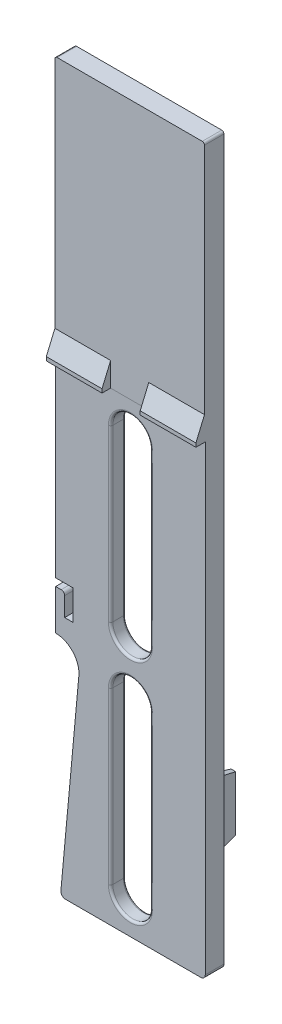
ISO-10303-21;
HEADER;
FILE_DESCRIPTION(('STEP AP214'),'2;1');
FILE_NAME('part.step','',(''),(''),'','','');
FILE_SCHEMA(('AUTOMOTIVE_DESIGN { 1 0 10303 214 1 1 1 1 }'));
ENDSEC;
DATA;
#1=APPLICATION_CONTEXT('core data for automotive mechanical design processes');
#2=APPLICATION_PROTOCOL_DEFINITION('international standard','automotive_design',2000,#1);
#3=PRODUCT_CONTEXT('',#1,'mechanical');
#4=PRODUCT('Part','Part','',(#3));
#5=PRODUCT_RELATED_PRODUCT_CATEGORY('part','',(#4));
#6=PRODUCT_DEFINITION_FORMATION('','',#4);
#7=PRODUCT_DEFINITION_CONTEXT('part definition',#1,'design');
#8=PRODUCT_DEFINITION('design','',#6,#7);
#9=PRODUCT_DEFINITION_SHAPE('','',#8);
#10=(LENGTH_UNIT() NAMED_UNIT(*) SI_UNIT(.MILLI.,.METRE.));
#11=(NAMED_UNIT(*) PLANE_ANGLE_UNIT() SI_UNIT($,.RADIAN.));
#12=(NAMED_UNIT(*) SI_UNIT($,.STERADIAN.) SOLID_ANGLE_UNIT());
#13=UNCERTAINTY_MEASURE_WITH_UNIT(LENGTH_MEASURE(1.E-05),#10,'distance_accuracy_value','');
#14=(GEOMETRIC_REPRESENTATION_CONTEXT(3) GLOBAL_UNCERTAINTY_ASSIGNED_CONTEXT((#13)) GLOBAL_UNIT_ASSIGNED_CONTEXT((#10,
#11,#12)) REPRESENTATION_CONTEXT('',''));
#15=CARTESIAN_POINT('',(0.,0.,0.));
#16=DIRECTION('',(0.,0.,1.));
#17=DIRECTION('',(1.,0.,0.));
#18=AXIS2_PLACEMENT_3D('',#15,#16,#17);
#19=CARTESIAN_POINT('',(0.,0.,-3.175));
#20=DIRECTION('',(0.,0.,1.));
#21=DIRECTION('',(1.,0.,0.));
#22=AXIS2_PLACEMENT_3D('',#19,#20,#21);
#23=PLANE('',#22);
#24=DIRECTION('',(-0.0915355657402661,-0.995801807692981,0.));
#25=VECTOR('',#24,1.);
#26=CARTESIAN_POINT('',(-11.7876000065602,1.08353351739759,-3.175));
#27=LINE('',#26,#25);
#28=CARTESIAN_POINT('',(-8.76299999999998,33.9877072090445,-3.17500000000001));
#29=VERTEX_POINT('',#28);
#30=CARTESIAN_POINT('',(-11.8107443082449,0.831750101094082,-3.175));
#31=VERTEX_POINT('',#30);
#32=EDGE_CURVE('E548',#29,#31,#27,.T.);
#33=ORIENTED_EDGE('',*,*,#32,.F.);
#34=CARTESIAN_POINT('',(-12.7,34.3496020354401,-3.17500000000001));
#35=DIRECTION('',(0.,0.,1.));
#36=DIRECTION('',(1.,0.,0.));
#37=AXIS2_PLACEMENT_3D('',#34,#35,#36);
#38=CIRCLE('',#37,3.95359796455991);
#39=CARTESIAN_POINT('',(-12.7,38.3032,-3.17500000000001));
#40=VERTEX_POINT('',#39);
#41=EDGE_CURVE('E552',#40,#29,#38,.F.);
#42=ORIENTED_EDGE('',*,*,#41,.F.);
#43=DIRECTION('',(0.,-1.,0.));
#44=VECTOR('',#43,1.);
#45=CARTESIAN_POINT('',(-12.7,0.,-3.17500000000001));
#46=LINE('',#45,#44);
#47=CARTESIAN_POINT('',(-12.7,45.1612,-3.17500000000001));
#48=VERTEX_POINT('',#47);
#49=EDGE_CURVE('E648',#48,#40,#46,.T.);
#50=ORIENTED_EDGE('',*,*,#49,.F.);
#51=DIRECTION('',(1.,0.,0.));
#52=VECTOR('',#51,1.);
#53=CARTESIAN_POINT('',(-11.176,45.1612,-3.17500000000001));
#54=LINE('',#53,#52);
#55=CARTESIAN_POINT('',(-11.7602,45.1612,-3.17500000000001));
#56=VERTEX_POINT('',#55);
#57=EDGE_CURVE('E997',#48,#56,#54,.T.);
#58=ORIENTED_EDGE('',*,*,#57,.T.);
#59=CARTESIAN_POINT('',(-11.7602,44.577,-3.17500000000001));
#60=DIRECTION('',(0.,0.,1.));
#61=DIRECTION('',(1.,0.,0.));
#62=AXIS2_PLACEMENT_3D('',#59,#60,#61);
#63=CIRCLE('',#62,0.5842);
#64=CARTESIAN_POINT('',(-11.176,44.577,-3.17500000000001));
#65=VERTEX_POINT('',#64);
#66=EDGE_CURVE('E1291',#56,#65,#63,.F.);
#67=ORIENTED_EDGE('',*,*,#66,.T.);
#68=DIRECTION('',(0.,-1.,0.));
#69=VECTOR('',#68,1.);
#70=CARTESIAN_POINT('',(-11.176,0.,-3.17500000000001));
#71=LINE('',#70,#69);
#72=CARTESIAN_POINT('',(-11.176,41.3512,-3.17500000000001));
#73=VERTEX_POINT('',#72);
#74=EDGE_CURVE('E628',#65,#73,#71,.T.);
#75=ORIENTED_EDGE('',*,*,#74,.T.);
#76=DIRECTION('',(-1.,0.,0.));
#77=VECTOR('',#76,1.);
#78=CARTESIAN_POINT('',(-11.176,41.3512,-3.175));
#79=LINE('',#78,#77);
#80=CARTESIAN_POINT('',(-9.72820000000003,41.3512,-3.175));
#81=VERTEX_POINT('',#80);
#82=EDGE_CURVE('E916',#81,#73,#79,.T.);
#83=ORIENTED_EDGE('',*,*,#82,.F.);
#84=DIRECTION('',(0.,-1.,0.));
#85=VECTOR('',#84,1.);
#86=CARTESIAN_POINT('',(-9.72820000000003,41.3512,-3.175));
#87=LINE('',#86,#85);
#88=CARTESIAN_POINT('',(-9.72820000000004,46.4312,-3.175));
#89=VERTEX_POINT('',#88);
#90=EDGE_CURVE('E912',#89,#81,#87,.T.);
#91=ORIENTED_EDGE('',*,*,#90,.F.);
#92=DIRECTION('',(-1.,0.,0.));
#93=VECTOR('',#92,1.);
#94=CARTESIAN_POINT('',(-12.7,46.4312,-3.17500000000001));
#95=LINE('',#94,#93);
#96=CARTESIAN_POINT('',(-12.7,46.4312,-3.17500000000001));
#97=VERTEX_POINT('',#96);
#98=EDGE_CURVE('E1000',#89,#97,#95,.T.);
#99=ORIENTED_EDGE('',*,*,#98,.T.);
#100=CARTESIAN_POINT('',(-12.7,122.809,-3.17500000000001));
#101=VERTEX_POINT('',#100);
#102=EDGE_CURVE('E633',#101,#97,#46,.T.);
#103=ORIENTED_EDGE('',*,*,#102,.F.);
#104=CARTESIAN_POINT('',(-12.319,122.809,-3.175));
#105=DIRECTION('',(0.,0.,1.));
#106=DIRECTION('',(1.,0.,0.));
#107=AXIS2_PLACEMENT_3D('',#104,#105,#106);
#108=CIRCLE('',#107,0.381);
#109=CARTESIAN_POINT('',(-12.319,123.19,-3.17500000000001));
#110=VERTEX_POINT('',#109);
#111=EDGE_CURVE('E69',#101,#110,#108,.F.);
#112=ORIENTED_EDGE('',*,*,#111,.T.);
#113=DIRECTION('',(-1.,0.,0.));
#114=VECTOR('',#113,1.);
#115=CARTESIAN_POINT('',(-12.7,123.19,-3.17500000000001));
#116=LINE('',#115,#114);
#117=CARTESIAN_POINT('',(12.319,123.19,-3.17500000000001));
#118=VERTEX_POINT('',#117);
#119=EDGE_CURVE('E640',#118,#110,#116,.T.);
#120=ORIENTED_EDGE('',*,*,#119,.F.);
#121=CARTESIAN_POINT('',(12.319,122.809,-3.175));
#122=DIRECTION('',(0.,0.,1.));
#123=DIRECTION('',(1.,0.,0.));
#124=AXIS2_PLACEMENT_3D('',#121,#122,#123);
#125=CIRCLE('',#124,0.381);
#126=CARTESIAN_POINT('',(12.7,122.809,-3.17500000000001));
#127=VERTEX_POINT('',#126);
#128=EDGE_CURVE('E76',#118,#127,#125,.F.);
#129=ORIENTED_EDGE('',*,*,#128,.T.);
#130=DIRECTION('',(0.,1.,0.));
#131=VECTOR('',#130,1.);
#132=CARTESIAN_POINT('',(12.7,123.19,-3.17500000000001));
#133=LINE('',#132,#131);
#134=CARTESIAN_POINT('',(12.7,0.761999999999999,-3.17500000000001));
#135=VERTEX_POINT('',#134);
#136=EDGE_CURVE('E643',#135,#127,#133,.T.);
#137=ORIENTED_EDGE('',*,*,#136,.F.);
#138=CARTESIAN_POINT('',(11.938,0.761999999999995,-3.175));
#139=DIRECTION('',(0.,0.,1.));
#140=DIRECTION('',(1.,0.,0.));
#141=AXIS2_PLACEMENT_3D('',#138,#139,#140);
#142=CIRCLE('',#141,0.762);
#143=CARTESIAN_POINT('',(11.938,0.,-3.17500000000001));
#144=VERTEX_POINT('',#143);
#145=EDGE_CURVE('E1275',#135,#144,#142,.F.);
#146=ORIENTED_EDGE('',*,*,#145,.T.);
#147=DIRECTION('',(1.,0.,0.));
#148=VECTOR('',#147,1.);
#149=CARTESIAN_POINT('',(12.7,0.,-3.17500000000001));
#150=LINE('',#149,#148);
#151=CARTESIAN_POINT('',(4.54770951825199,0.,-3.17500000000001));
#152=VERTEX_POINT('',#151);
#153=EDGE_CURVE('E645',#152,#144,#150,.T.);
#154=ORIENTED_EDGE('',*,*,#153,.F.);
#155=CARTESIAN_POINT('',(4.54770951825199,0.253999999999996,-3.175));
#156=DIRECTION('',(0.,0.,1.));
#157=DIRECTION('',(1.,0.,0.));
#158=AXIS2_PLACEMENT_3D('',#155,#156,#157);
#159=CIRCLE('',#158,0.254);
#160=CARTESIAN_POINT('',(4.39143084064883,0.454232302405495,-3.175));
#161=VERTEX_POINT('',#160);
#162=EDGE_CURVE('E672',#152,#161,#159,.F.);
#163=ORIENTED_EDGE('',*,*,#162,.T.);
#164=CARTESIAN_POINT('',(0.,6.08076000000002,-3.175));
#165=DIRECTION('',(0.,0.,1.));
#166=DIRECTION('',(1.,0.,0.));
#167=AXIS2_PLACEMENT_3D('',#164,#165,#166);
#168=CIRCLE('',#167,7.1374);
#169=CARTESIAN_POINT('',(7.1374,6.08076000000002,-3.175));
#170=VERTEX_POINT('',#169);
#171=EDGE_CURVE('E979',#161,#170,#168,.T.);
#172=ORIENTED_EDGE('',*,*,#171,.T.);
#173=DIRECTION('',(0.,1.,0.));
#174=VECTOR('',#173,1.);
#175=CARTESIAN_POINT('',(7.1374,6.08076000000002,-3.175));
#176=LINE('',#175,#174);
#177=CARTESIAN_POINT('',(7.13739999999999,12.7,-3.175));
#178=VERTEX_POINT('',#177);
#179=EDGE_CURVE('E961',#170,#178,#176,.T.);
#180=ORIENTED_EDGE('',*,*,#179,.T.);
#181=DIRECTION('',(-1.,0.,0.));
#182=VECTOR('',#181,1.);
#183=CARTESIAN_POINT('',(7.1374,12.7,-3.175));
#184=LINE('',#183,#182);
#185=CARTESIAN_POINT('',(8.78839999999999,12.7,-3.175));
#186=VERTEX_POINT('',#185);
#187=EDGE_CURVE('E1331',#186,#178,#184,.T.);
#188=ORIENTED_EDGE('',*,*,#187,.F.);
#189=DIRECTION('',(0.,1.,0.));
#190=VECTOR('',#189,1.);
#191=CARTESIAN_POINT('',(8.7884,6.08076000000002,-3.175));
#192=LINE('',#191,#190);
#193=CARTESIAN_POINT('',(8.7884,6.08076000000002,-3.175));
#194=VERTEX_POINT('',#193);
#195=EDGE_CURVE('E986',#194,#186,#192,.T.);
#196=ORIENTED_EDGE('',*,*,#195,.F.);
#197=CARTESIAN_POINT('',(0.,6.08076000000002,-3.175));
#198=DIRECTION('',(0.,0.,1.));
#199=DIRECTION('',(1.,0.,0.));
#200=AXIS2_PLACEMENT_3D('',#197,#198,#199);
#201=CIRCLE('',#200,8.7884);
#202=CARTESIAN_POINT('',(7.51477962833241,1.524,-3.175));
#203=VERTEX_POINT('',#202);
#204=EDGE_CURVE('E942',#203,#194,#201,.T.);
#205=ORIENTED_EDGE('',*,*,#204,.F.);
#206=DIRECTION('',(1.,0.,0.));
#207=VECTOR('',#206,1.);
#208=CARTESIAN_POINT('',(12.7,1.52399999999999,-3.17500000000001));
#209=LINE('',#208,#207);
#210=CARTESIAN_POINT('',(11.176,1.524,-3.17500000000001));
#211=VERTEX_POINT('',#210);
#212=EDGE_CURVE('E626',#203,#211,#209,.T.);
#213=ORIENTED_EDGE('',*,*,#212,.T.);
#214=DIRECTION('',(0.,1.,0.));
#215=VECTOR('',#214,1.);
#216=CARTESIAN_POINT('',(11.176,123.19,-3.17500000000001));
#217=LINE('',#216,#215);
#218=CARTESIAN_POINT('',(11.176,48.940952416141,-3.17500000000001));
#219=VERTEX_POINT('',#218);
#220=EDGE_CURVE('E655',#211,#219,#217,.T.);
#221=ORIENTED_EDGE('',*,*,#220,.T.);
#222=CARTESIAN_POINT('',(10.0833697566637,49.8828207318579,-3.175));
#223=DIRECTION('',(0.,0.,1.));
#224=DIRECTION('',(1.,0.,0.));
#225=AXIS2_PLACEMENT_3D('',#222,#223,#224);
#226=CIRCLE('',#225,1.44255217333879);
#227=CARTESIAN_POINT('',(8.7884,49.2472028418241,-3.175));
#228=VERTEX_POINT('',#227);
#229=EDGE_CURVE('E832',#228,#219,#226,.T.);
#230=ORIENTED_EDGE('',*,*,#229,.F.);
#231=CARTESIAN_POINT('',(8.78839999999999,25.4,-3.175));
#232=VERTEX_POINT('',#231);
#233=EDGE_CURVE('E989',#232,#228,#192,.T.);
#234=ORIENTED_EDGE('',*,*,#233,.F.);
#235=DIRECTION('',(1.,0.,0.));
#236=VECTOR('',#235,1.);
#237=CARTESIAN_POINT('',(7.1374,25.4,-3.175));
#238=LINE('',#237,#236);
#239=CARTESIAN_POINT('',(7.13739999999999,25.4,-3.175));
#240=VERTEX_POINT('',#239);
#241=EDGE_CURVE('E1336',#240,#232,#238,.T.);
#242=ORIENTED_EDGE('',*,*,#241,.F.);
#243=CARTESIAN_POINT('',(7.1374,72.6186,-3.175));
#244=VERTEX_POINT('',#243);
#245=EDGE_CURVE('E965',#240,#244,#176,.T.);
#246=ORIENTED_EDGE('',*,*,#245,.T.);
#247=CARTESIAN_POINT('',(0.,72.6186,-3.175));
#248=DIRECTION('',(0.,0.,1.));
#249=DIRECTION('',(1.,0.,0.));
#250=AXIS2_PLACEMENT_3D('',#247,#248,#249);
#251=CIRCLE('',#250,7.1374);
#252=CARTESIAN_POINT('',(-7.1374,72.6186,-3.175));
#253=VERTEX_POINT('',#252);
#254=EDGE_CURVE('E964',#244,#253,#251,.T.);
#255=ORIENTED_EDGE('',*,*,#254,.T.);
#256=DIRECTION('',(0.,-1.,0.));
#257=VECTOR('',#256,1.);
#258=CARTESIAN_POINT('',(-7.1374,6.08076000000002,-3.175));
#259=LINE('',#258,#257);
#260=CARTESIAN_POINT('',(-7.1374,6.08076000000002,-3.175));
#261=VERTEX_POINT('',#260);
#262=EDGE_CURVE('E993',#253,#261,#259,.T.);
#263=ORIENTED_EDGE('',*,*,#262,.T.);
#264=CARTESIAN_POINT('',(-4.39143084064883,0.454232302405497,-3.175));
#265=VERTEX_POINT('',#264);
#266=EDGE_CURVE('E990',#261,#265,#168,.T.);
#267=ORIENTED_EDGE('',*,*,#266,.T.);
#268=CARTESIAN_POINT('',(-4.54770951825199,0.253999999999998,-3.175));
#269=DIRECTION('',(0.,0.,1.));
#270=DIRECTION('',(1.,0.,0.));
#271=AXIS2_PLACEMENT_3D('',#268,#269,#270);
#272=CIRCLE('',#271,0.254);
#273=CARTESIAN_POINT('',(-4.54770951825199,0.,-3.17500000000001));
#274=VERTEX_POINT('',#273);
#275=EDGE_CURVE('E674',#265,#274,#272,.F.);
#276=ORIENTED_EDGE('',*,*,#275,.T.);
#277=CARTESIAN_POINT('',(-11.0519433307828,0.,-3.17500000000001));
#278=VERTEX_POINT('',#277);
#279=EDGE_CURVE('E646',#278,#274,#150,.T.);
#280=ORIENTED_EDGE('',*,*,#279,.F.);
#281=CARTESIAN_POINT('',(-11.0519433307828,0.762,-3.175));
#282=DIRECTION('',(0.,0.,1.));
#283=DIRECTION('',(1.,0.,0.));
#284=AXIS2_PLACEMENT_3D('',#281,#282,#283);
#285=CIRCLE('',#284,0.762);
#286=EDGE_CURVE('E555',#278,#31,#285,.F.);
#287=ORIENTED_EDGE('',*,*,#286,.T.);
#288=EDGE_LOOP('',(#33,#42,#50,#58,#67,#75,#83,#91,#99,#103,#112,#120,#129,#137,#146,#154,#163,
#172,#180,#188,#196,#205,#213,#221,#230,#234,#242,#246,#255,#263,#267,#276,#280,#287));
#289=FACE_BOUND('',#288,.T.);
#290=DIRECTION('',(0.,1.,0.));
#291=VECTOR('',#290,1.);
#292=CARTESIAN_POINT('',(0.825499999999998,121.666,-3.175));
#293=LINE('',#292,#291);
#294=CARTESIAN_POINT('',(0.825499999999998,81.3681442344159,-3.175));
#295=VERTEX_POINT('',#294);
#296=CARTESIAN_POINT('',(0.825499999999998,121.666,-3.175));
#297=VERTEX_POINT('',#296);
#298=EDGE_CURVE('E863',#295,#297,#293,.T.);
#299=ORIENTED_EDGE('',*,*,#298,.F.);
#300=CARTESIAN_POINT('',(0.,72.6186,-3.175));
#301=DIRECTION('',(0.,0.,1.));
#302=DIRECTION('',(1.,0.,0.));
#303=AXIS2_PLACEMENT_3D('',#300,#301,#302);
#304=CIRCLE('',#303,8.7884);
#305=CARTESIAN_POINT('',(7.1374,77.7463183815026,-3.175));
#306=VERTEX_POINT('',#305);
#307=EDGE_CURVE('E982',#306,#295,#304,.T.);
#308=ORIENTED_EDGE('',*,*,#307,.F.);
#309=DIRECTION('',(0.,-1.,0.));
#310=VECTOR('',#309,1.);
#311=CARTESIAN_POINT('',(7.1374,72.6186,-3.175));
#312=LINE('',#311,#310);
#313=CARTESIAN_POINT('',(7.1374,121.666,-3.175));
#314=VERTEX_POINT('',#313);
#315=EDGE_CURVE('E880',#314,#306,#312,.T.);
#316=ORIENTED_EDGE('',*,*,#315,.F.);
#317=DIRECTION('',(-1.,0.,0.));
#318=VECTOR('',#317,1.);
#319=CARTESIAN_POINT('',(-12.7,121.666,-3.17500000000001));
#320=LINE('',#319,#318);
#321=EDGE_CURVE('E653',#314,#297,#320,.T.);
#322=ORIENTED_EDGE('',*,*,#321,.T.);
#323=EDGE_LOOP('',(#299,#308,#316,#322));
#324=FACE_BOUND('',#323,.T.);
#325=CARTESIAN_POINT('',(-0.825500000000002,81.3681442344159,-3.175));
#326=VERTEX_POINT('',#325);
#327=CARTESIAN_POINT('',(-7.1374,77.7463183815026,-3.175));
#328=VERTEX_POINT('',#327);
#329=EDGE_CURVE('E985',#326,#328,#304,.T.);
#330=ORIENTED_EDGE('',*,*,#329,.F.);
#331=DIRECTION('',(0.,1.,0.));
#332=VECTOR('',#331,1.);
#333=CARTESIAN_POINT('',(-0.825500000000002,121.666,-3.175));
#334=LINE('',#333,#332);
#335=CARTESIAN_POINT('',(-0.825500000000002,121.666,-3.17500000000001));
#336=VERTEX_POINT('',#335);
#337=EDGE_CURVE('E860',#326,#336,#334,.T.);
#338=ORIENTED_EDGE('',*,*,#337,.T.);
#339=CARTESIAN_POINT('',(-7.1374,121.666,-3.17500000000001));
#340=VERTEX_POINT('',#339);
#341=EDGE_CURVE('E654',#336,#340,#320,.T.);
#342=ORIENTED_EDGE('',*,*,#341,.T.);
#343=DIRECTION('',(0.,1.,0.));
#344=VECTOR('',#343,1.);
#345=CARTESIAN_POINT('',(-7.1374,72.6186,-3.175));
#346=LINE('',#345,#344);
#347=EDGE_CURVE('E902',#328,#340,#346,.T.);
#348=ORIENTED_EDGE('',*,*,#347,.F.);
#349=EDGE_LOOP('',(#330,#338,#342,#348));
#350=FACE_BOUND('',#349,.T.);
#351=CARTESIAN_POINT('',(-11.176,121.666,-3.17500000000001));
#352=VERTEX_POINT('',#351);
#353=CARTESIAN_POINT('',(-11.176,51.5479162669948,-3.175));
#354=VERTEX_POINT('',#353);
#355=EDGE_CURVE('E623',#352,#354,#71,.T.);
#356=ORIENTED_EDGE('',*,*,#355,.T.);
#357=CARTESIAN_POINT('',(-9.98220000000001,50.8307569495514,-3.175));
#358=DIRECTION('',(0.,0.,1.));
#359=DIRECTION('',(1.,0.,0.));
#360=AXIS2_PLACEMENT_3D('',#357,#358,#359);
#361=CIRCLE('',#360,1.39265068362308);
#362=CARTESIAN_POINT('',(-8.7884,51.5479162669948,-3.175));
#363=VERTEX_POINT('',#362);
#364=EDGE_CURVE('E846',#363,#354,#361,.T.);
#365=ORIENTED_EDGE('',*,*,#364,.F.);
#366=DIRECTION('',(0.,-1.,0.));
#367=VECTOR('',#366,1.);
#368=CARTESIAN_POINT('',(-8.7884,6.08076000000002,-3.175));
#369=LINE('',#368,#367);
#370=CARTESIAN_POINT('',(-8.7884,121.666,-3.17500000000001));
#371=VERTEX_POINT('',#370);
#372=EDGE_CURVE('E956',#371,#363,#369,.T.);
#373=ORIENTED_EDGE('',*,*,#372,.F.);
#374=EDGE_CURVE('E639',#371,#352,#320,.T.);
#375=ORIENTED_EDGE('',*,*,#374,.T.);
#376=EDGE_LOOP('',(#356,#365,#373,#375));
#377=FACE_BOUND('',#376,.T.);
#378=CARTESIAN_POINT('',(-11.176,50.1135976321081,-3.175));
#379=VERTEX_POINT('',#378);
#380=CARTESIAN_POINT('',(-8.7884,50.1135976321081,-3.175));
#381=VERTEX_POINT('',#380);
#382=EDGE_CURVE('E845',#379,#381,#361,.T.);
#383=ORIENTED_EDGE('',*,*,#382,.F.);
#384=CARTESIAN_POINT('',(-11.176,48.0822,-3.17500000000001));
#385=VERTEX_POINT('',#384);
#386=EDGE_CURVE('E627',#379,#385,#71,.T.);
#387=ORIENTED_EDGE('',*,*,#386,.T.);
#388=DIRECTION('',(-1.,0.,0.));
#389=VECTOR('',#388,1.);
#390=CARTESIAN_POINT('',(-11.176,48.0822,-3.175));
#391=LINE('',#390,#389);
#392=CARTESIAN_POINT('',(-8.7884,48.0822,-3.175));
#393=VERTEX_POINT('',#392);
#394=EDGE_CURVE('E909',#393,#385,#391,.T.);
#395=ORIENTED_EDGE('',*,*,#394,.F.);
#396=EDGE_CURVE('E959',#381,#393,#369,.T.);
#397=ORIENTED_EDGE('',*,*,#396,.F.);
#398=EDGE_LOOP('',(#383,#387,#395,#397));
#399=FACE_BOUND('',#398,.T.);
#400=CARTESIAN_POINT('',(8.7884,50.5184386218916,-3.175));
#401=VERTEX_POINT('',#400);
#402=CARTESIAN_POINT('',(8.7884,121.666,-3.175));
#403=VERTEX_POINT('',#402);
#404=EDGE_CURVE('E951',#401,#403,#192,.T.);
#405=ORIENTED_EDGE('',*,*,#404,.F.);
#406=CARTESIAN_POINT('',(11.176,50.8246890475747,-3.17500000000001));
#407=VERTEX_POINT('',#406);
#408=EDGE_CURVE('E833',#407,#401,#226,.T.);
#409=ORIENTED_EDGE('',*,*,#408,.F.);
#410=CARTESIAN_POINT('',(11.176,121.666,-3.17500000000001));
#411=VERTEX_POINT('',#410);
#412=EDGE_CURVE('E658',#407,#411,#217,.T.);
#413=ORIENTED_EDGE('',*,*,#412,.T.);
#414=EDGE_CURVE('E650',#411,#403,#320,.T.);
#415=ORIENTED_EDGE('',*,*,#414,.T.);
#416=EDGE_LOOP('',(#405,#409,#413,#415));
#417=FACE_BOUND('',#416,.T.);
#418=ADVANCED_FACE('F61',(#289,#324,#350,#377,#399,#417),#23,.F.);
#419=CARTESIAN_POINT('',(17.0184668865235,79.756,1.5875));
#420=DIRECTION('',(0.,-0.391862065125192,-0.920023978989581));
#421=DIRECTION('',(0.,0.920023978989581,-0.391862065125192));
#422=AXIS2_PLACEMENT_3D('',#419,#420,#421);
#423=PLANE('',#422);
#424=DIRECTION('',(-1.,0.,0.));
#425=VECTOR('',#424,1.);
#426=CARTESIAN_POINT('',(17.0184668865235,83.185,0.127));
#427=LINE('',#426,#425);
#428=CARTESIAN_POINT('',(12.7,83.185,0.127));
#429=VERTEX_POINT('',#428);
#430=CARTESIAN_POINT('',(3.2385,83.185,0.127));
#431=VERTEX_POINT('',#430);
#432=EDGE_CURVE('E812',#429,#431,#427,.T.);
#433=ORIENTED_EDGE('',*,*,#432,.T.);
#434=DIRECTION('',(0.,-0.920023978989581,0.391862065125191));
#435=VECTOR('',#434,1.);
#436=CARTESIAN_POINT('',(3.2385,79.756,1.5875));
#437=LINE('',#436,#435);
#438=CARTESIAN_POINT('',(3.2385,79.756,1.5875));
#439=VERTEX_POINT('',#438);
#440=EDGE_CURVE('E1134',#431,#439,#437,.T.);
#441=ORIENTED_EDGE('',*,*,#440,.T.);
#442=DIRECTION('',(-1.,0.,0.));
#443=VECTOR('',#442,1.);
#444=CARTESIAN_POINT('',(17.0184668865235,79.756,1.5875));
#445=LINE('',#444,#443);
#446=CARTESIAN_POINT('',(12.7,79.756,1.5875));
#447=VERTEX_POINT('',#446);
#448=EDGE_CURVE('E1110',#447,#439,#445,.T.);
#449=ORIENTED_EDGE('',*,*,#448,.F.);
#450=DIRECTION('',(0.,-0.920023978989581,0.391862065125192));
#451=VECTOR('',#450,1.);
#452=CARTESIAN_POINT('',(12.7,79.756,1.5875));
#453=LINE('',#452,#451);
#454=EDGE_CURVE('E1093',#429,#447,#453,.T.);
#455=ORIENTED_EDGE('',*,*,#454,.F.);
#456=EDGE_LOOP('',(#433,#441,#449,#455));
#457=FACE_BOUND('',#456,.T.);
#458=ADVANCED_FACE('F1132',(#457),#423,.F.);
#459=CARTESIAN_POINT('',(17.0184668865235,79.121,1.5875));
#460=DIRECTION('',(0.,0.,-1.));
#461=DIRECTION('',(-1.,0.,0.));
#462=AXIS2_PLACEMENT_3D('',#459,#460,#461);
#463=PLANE('',#462);
#464=ORIENTED_EDGE('',*,*,#448,.T.);
#465=DIRECTION('',(0.,-1.,0.));
#466=VECTOR('',#465,1.);
#467=CARTESIAN_POINT('',(3.2385,79.121,1.5875));
#468=LINE('',#467,#466);
#469=CARTESIAN_POINT('',(3.2385,79.121,1.5875));
#470=VERTEX_POINT('',#469);
#471=EDGE_CURVE('E1101',#439,#470,#468,.T.);
#472=ORIENTED_EDGE('',*,*,#471,.T.);
#473=DIRECTION('',(-1.,0.,0.));
#474=VECTOR('',#473,1.);
#475=CARTESIAN_POINT('',(17.0184668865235,79.121,1.5875));
#476=LINE('',#475,#474);
#477=CARTESIAN_POINT('',(12.7,79.121,1.5875));
#478=VERTEX_POINT('',#477);
#479=EDGE_CURVE('E1096',#478,#470,#476,.T.);
#480=ORIENTED_EDGE('',*,*,#479,.F.);
#481=DIRECTION('',(0.,-1.,0.));
#482=VECTOR('',#481,1.);
#483=CARTESIAN_POINT('',(12.7,79.121,1.5875));
#484=LINE('',#483,#482);
#485=EDGE_CURVE('E824',#447,#478,#484,.T.);
#486=ORIENTED_EDGE('',*,*,#485,.F.);
#487=EDGE_LOOP('',(#464,#472,#480,#486));
#488=FACE_BOUND('',#487,.T.);
#489=ADVANCED_FACE('F1155',(#488),#463,.F.);
#490=CARTESIAN_POINT('',(0.,0.,0.));
#491=DIRECTION('',(0.,0.,1.));
#492=DIRECTION('',(1.,0.,0.));
#493=AXIS2_PLACEMENT_3D('',#490,#491,#492);
#494=PLANE('',#493);
#495=DIRECTION('',(0.,-1.,0.));
#496=VECTOR('',#495,1.);
#497=CARTESIAN_POINT('',(-3.7465,34.7345,0.));
#498=LINE('',#497,#496);
#499=CARTESIAN_POINT('',(-3.74650000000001,5.8293,0.));
#500=VERTEX_POINT('',#499);
#501=CARTESIAN_POINT('',(-3.7465,34.7345,0.));
#502=VERTEX_POINT('',#501);
#503=EDGE_CURVE('E697',#500,#502,#498,.F.);
#504=ORIENTED_EDGE('',*,*,#503,.T.);
#505=CARTESIAN_POINT('',(0.,34.7345,0.));
#506=DIRECTION('',(0.,0.,1.));
#507=DIRECTION('',(1.,0.,0.));
#508=AXIS2_PLACEMENT_3D('',#505,#506,#507);
#509=CIRCLE('',#508,3.7465);
#510=CARTESIAN_POINT('',(3.7465,34.7345,0.));
#511=VERTEX_POINT('',#510);
#512=EDGE_CURVE('E703',#502,#511,#509,.F.);
#513=ORIENTED_EDGE('',*,*,#512,.T.);
#514=DIRECTION('',(0.,1.,0.));
#515=VECTOR('',#514,1.);
#516=CARTESIAN_POINT('',(3.74650000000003,5.8293,0.));
#517=LINE('',#516,#515);
#518=CARTESIAN_POINT('',(3.74650000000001,5.8293,0.));
#519=VERTEX_POINT('',#518);
#520=EDGE_CURVE('E701',#511,#519,#517,.F.);
#521=ORIENTED_EDGE('',*,*,#520,.T.);
#522=CARTESIAN_POINT('',(0.,5.8293,0.));
#523=DIRECTION('',(0.,0.,1.));
#524=DIRECTION('',(1.,0.,0.));
#525=AXIS2_PLACEMENT_3D('',#522,#523,#524);
#526=CIRCLE('',#525,3.74650000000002);
#527=EDGE_CURVE('E699',#519,#500,#526,.F.);
#528=ORIENTED_EDGE('',*,*,#527,.T.);
#529=EDGE_LOOP('',(#504,#513,#521,#528));
#530=FACE_BOUND('',#529,.T.);
#531=DIRECTION('',(0.,-1.,0.));
#532=VECTOR('',#531,1.);
#533=CARTESIAN_POINT('',(-3.74650000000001,73.3425,0.));
#534=LINE('',#533,#532);
#535=CARTESIAN_POINT('',(-3.74650000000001,44.4373,0.));
#536=VERTEX_POINT('',#535);
#537=CARTESIAN_POINT('',(-3.74650000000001,73.3425,0.));
#538=VERTEX_POINT('',#537);
#539=EDGE_CURVE('E706',#536,#538,#534,.F.);
#540=ORIENTED_EDGE('',*,*,#539,.T.);
#541=CARTESIAN_POINT('',(0.,73.3425,0.));
#542=DIRECTION('',(0.,0.,1.));
#543=DIRECTION('',(1.,0.,0.));
#544=AXIS2_PLACEMENT_3D('',#541,#542,#543);
#545=CIRCLE('',#544,3.7465);
#546=CARTESIAN_POINT('',(3.74649999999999,73.3425,0.));
#547=VERTEX_POINT('',#546);
#548=EDGE_CURVE('E712',#538,#547,#545,.F.);
#549=ORIENTED_EDGE('',*,*,#548,.T.);
#550=DIRECTION('',(0.,1.,0.));
#551=VECTOR('',#550,1.);
#552=CARTESIAN_POINT('',(3.74650000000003,44.4373,0.));
#553=LINE('',#552,#551);
#554=CARTESIAN_POINT('',(3.74650000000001,44.4373,0.));
#555=VERTEX_POINT('',#554);
#556=EDGE_CURVE('E710',#547,#555,#553,.F.);
#557=ORIENTED_EDGE('',*,*,#556,.T.);
#558=CARTESIAN_POINT('',(0.,44.4373,0.));
#559=DIRECTION('',(0.,0.,1.));
#560=DIRECTION('',(1.,0.,0.));
#561=AXIS2_PLACEMENT_3D('',#558,#559,#560);
#562=CIRCLE('',#561,3.74650000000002);
#563=EDGE_CURVE('E708',#555,#536,#562,.F.);
#564=ORIENTED_EDGE('',*,*,#563,.T.);
#565=EDGE_LOOP('',(#540,#549,#557,#564));
#566=FACE_BOUND('',#565,.T.);
#567=DIRECTION('',(-0.0915355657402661,-0.995801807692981,0.));
#568=VECTOR('',#567,1.);
#569=CARTESIAN_POINT('',(-11.7876000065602,1.08353351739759,0.));
#570=LINE('',#569,#568);
#571=CARTESIAN_POINT('',(-8.76299999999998,33.9877072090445,0.));
#572=VERTEX_POINT('',#571);
#573=CARTESIAN_POINT('',(-11.8107443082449,0.831750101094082,0.));
#574=VERTEX_POINT('',#573);
#575=EDGE_CURVE('E559',#572,#574,#570,.T.);
#576=ORIENTED_EDGE('',*,*,#575,.T.);
#577=CARTESIAN_POINT('',(-11.0519433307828,0.762,0.));
#578=DIRECTION('',(0.,0.,1.));
#579=DIRECTION('',(1.,0.,0.));
#580=AXIS2_PLACEMENT_3D('',#577,#578,#579);
#581=CIRCLE('',#580,0.762);
#582=CARTESIAN_POINT('',(-11.0519433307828,0.,0.));
#583=VERTEX_POINT('',#582);
#584=EDGE_CURVE('E1035',#574,#583,#581,.T.);
#585=ORIENTED_EDGE('',*,*,#584,.T.);
#586=DIRECTION('',(1.,0.,0.));
#587=VECTOR('',#586,1.);
#588=CARTESIAN_POINT('',(-12.7,0.,0.));
#589=LINE('',#588,#587);
#590=CARTESIAN_POINT('',(11.938,0.,0.));
#591=VERTEX_POINT('',#590);
#592=EDGE_CURVE('E664',#583,#591,#589,.T.);
#593=ORIENTED_EDGE('',*,*,#592,.T.);
#594=CARTESIAN_POINT('',(11.938,0.761999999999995,0.));
#595=DIRECTION('',(0.,0.,1.));
#596=DIRECTION('',(1.,0.,0.));
#597=AXIS2_PLACEMENT_3D('',#594,#595,#596);
#598=CIRCLE('',#597,0.762);
#599=CARTESIAN_POINT('',(12.7,0.762000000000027,0.));
#600=VERTEX_POINT('',#599);
#601=EDGE_CURVE('E1044',#591,#600,#598,.T.);
#602=ORIENTED_EDGE('',*,*,#601,.T.);
#603=DIRECTION('',(0.,1.,0.));
#604=VECTOR('',#603,1.);
#605=CARTESIAN_POINT('',(12.7,123.19,0.));
#606=LINE('',#605,#604);
#607=CARTESIAN_POINT('',(12.7,79.121,0.));
#608=VERTEX_POINT('',#607);
#609=EDGE_CURVE('E657',#600,#608,#606,.T.);
#610=ORIENTED_EDGE('',*,*,#609,.T.);
#611=DIRECTION('',(1.,0.,0.));
#612=VECTOR('',#611,1.);
#613=CARTESIAN_POINT('',(-12.7,79.121,0.));
#614=LINE('',#613,#612);
#615=CARTESIAN_POINT('',(-12.7,79.121,0.));
#616=VERTEX_POINT('',#615);
#617=EDGE_CURVE('E820',#616,#608,#614,.T.);
#618=ORIENTED_EDGE('',*,*,#617,.F.);
#619=DIRECTION('',(0.,-1.,0.));
#620=VECTOR('',#619,1.);
#621=CARTESIAN_POINT('',(-12.7,123.19,0.));
#622=LINE('',#621,#620);
#623=CARTESIAN_POINT('',(-12.7,46.4312,0.));
#624=VERTEX_POINT('',#623);
#625=EDGE_CURVE('E662',#616,#624,#622,.T.);
#626=ORIENTED_EDGE('',*,*,#625,.T.);
#627=DIRECTION('',(-1.,0.,0.));
#628=VECTOR('',#627,1.);
#629=CARTESIAN_POINT('',(-12.7,46.4312,0.));
#630=LINE('',#629,#628);
#631=CARTESIAN_POINT('',(-9.72820000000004,46.4312,0.));
#632=VERTEX_POINT('',#631);
#633=EDGE_CURVE('E1001',#632,#624,#630,.T.);
#634=ORIENTED_EDGE('',*,*,#633,.F.);
#635=DIRECTION('',(0.,1.,0.));
#636=VECTOR('',#635,1.);
#637=CARTESIAN_POINT('',(-9.72820000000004,46.4312,0.));
#638=LINE('',#637,#636);
#639=CARTESIAN_POINT('',(-9.72820000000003,41.3512,0.));
#640=VERTEX_POINT('',#639);
#641=EDGE_CURVE('E1012',#640,#632,#638,.T.);
#642=ORIENTED_EDGE('',*,*,#641,.F.);
#643=DIRECTION('',(1.,0.,0.));
#644=VECTOR('',#643,1.);
#645=CARTESIAN_POINT('',(-9.72820000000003,41.3512,0.));
#646=LINE('',#645,#644);
#647=CARTESIAN_POINT('',(-11.176,41.3512,0.));
#648=VERTEX_POINT('',#647);
#649=EDGE_CURVE('E1009',#648,#640,#646,.T.);
#650=ORIENTED_EDGE('',*,*,#649,.F.);
#651=DIRECTION('',(0.,-1.,0.));
#652=VECTOR('',#651,1.);
#653=CARTESIAN_POINT('',(-11.176,41.3512,0.));
#654=LINE('',#653,#652);
#655=CARTESIAN_POINT('',(-11.176,44.577,0.));
#656=VERTEX_POINT('',#655);
#657=EDGE_CURVE('E1007',#656,#648,#654,.T.);
#658=ORIENTED_EDGE('',*,*,#657,.F.);
#659=CARTESIAN_POINT('',(-11.7602,44.577,0.));
#660=DIRECTION('',(0.,0.,1.));
#661=DIRECTION('',(1.,0.,0.));
#662=AXIS2_PLACEMENT_3D('',#659,#660,#661);
#663=CIRCLE('',#662,0.5842);
#664=CARTESIAN_POINT('',(-11.7602,45.1612,0.));
#665=VERTEX_POINT('',#664);
#666=EDGE_CURVE('E1032',#656,#665,#663,.T.);
#667=ORIENTED_EDGE('',*,*,#666,.T.);
#668=DIRECTION('',(1.,0.,0.));
#669=VECTOR('',#668,1.);
#670=CARTESIAN_POINT('',(-11.176,45.1612,0.));
#671=LINE('',#670,#669);
#672=CARTESIAN_POINT('',(-12.7,45.1612,0.));
#673=VERTEX_POINT('',#672);
#674=EDGE_CURVE('E995',#673,#665,#671,.T.);
#675=ORIENTED_EDGE('',*,*,#674,.F.);
#676=CARTESIAN_POINT('',(-12.7,38.3032,0.));
#677=VERTEX_POINT('',#676);
#678=EDGE_CURVE('E661',#673,#677,#622,.T.);
#679=ORIENTED_EDGE('',*,*,#678,.T.);
#680=CARTESIAN_POINT('',(-12.7,34.3496020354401,0.));
#681=DIRECTION('',(0.,0.,1.));
#682=DIRECTION('',(1.,0.,0.));
#683=AXIS2_PLACEMENT_3D('',#680,#681,#682);
#684=CIRCLE('',#683,3.95359796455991);
#685=EDGE_CURVE('E560',#677,#572,#684,.F.);
#686=ORIENTED_EDGE('',*,*,#685,.T.);
#687=EDGE_LOOP('',(#576,#585,#593,#602,#610,#618,#626,#634,#642,#650,#658,#667,#675,#679,#686));
#688=FACE_BOUND('',#687,.T.);
#689=ADVANCED_FACE('F1030',(#530,#566,#688),#494,.T.);
#690=CARTESIAN_POINT('',(0.,0.,-2.032));
#691=DIRECTION('',(0.,0.,1.));
#692=DIRECTION('',(1.,0.,0.));
#693=AXIS2_PLACEMENT_3D('',#690,#691,#692);
#694=PLANE('',#693);
#695=CARTESIAN_POINT('',(10.0833697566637,49.8828207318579,-2.032));
#696=DIRECTION('',(0.,0.,-1.));
#697=DIRECTION('',(-1.,0.,0.));
#698=AXIS2_PLACEMENT_3D('',#695,#696,#697);
#699=CIRCLE('',#698,1.44255217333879);
#700=CARTESIAN_POINT('',(11.176,48.940952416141,-2.032));
#701=VERTEX_POINT('',#700);
#702=CARTESIAN_POINT('',(8.7884,49.2472028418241,-2.032));
#703=VERTEX_POINT('',#702);
#704=EDGE_CURVE('E775',#701,#703,#699,.T.);
#705=ORIENTED_EDGE('',*,*,#704,.F.);
#706=DIRECTION('',(0.,-1.,0.));
#707=VECTOR('',#706,1.);
#708=CARTESIAN_POINT('',(11.176,123.19,-2.032));
#709=LINE('',#708,#707);
#710=CARTESIAN_POINT('',(11.176,1.524,-2.032));
#711=VERTEX_POINT('',#710);
#712=EDGE_CURVE('E617',#701,#711,#709,.T.);
#713=ORIENTED_EDGE('',*,*,#712,.T.);
#714=DIRECTION('',(-1.,0.,0.));
#715=VECTOR('',#714,1.);
#716=CARTESIAN_POINT('',(12.7,1.52399999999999,-2.032));
#717=LINE('',#716,#715);
#718=CARTESIAN_POINT('',(7.51477962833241,1.524,-2.032));
#719=VERTEX_POINT('',#718);
#720=EDGE_CURVE('E611',#711,#719,#717,.T.);
#721=ORIENTED_EDGE('',*,*,#720,.T.);
#722=CARTESIAN_POINT('',(0.,6.08076000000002,-2.032));
#723=DIRECTION('',(0.,0.,-1.));
#724=DIRECTION('',(-1.,0.,0.));
#725=AXIS2_PLACEMENT_3D('',#722,#723,#724);
#726=CIRCLE('',#725,8.7884);
#727=CARTESIAN_POINT('',(8.7884,6.08076000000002,-2.032));
#728=VERTEX_POINT('',#727);
#729=EDGE_CURVE('E957',#728,#719,#726,.T.);
#730=ORIENTED_EDGE('',*,*,#729,.F.);
#731=DIRECTION('',(0.,-1.,0.));
#732=VECTOR('',#731,1.);
#733=CARTESIAN_POINT('',(8.7884,6.08076000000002,-2.032));
#734=LINE('',#733,#732);
#735=EDGE_CURVE('E947',#703,#728,#734,.T.);
#736=ORIENTED_EDGE('',*,*,#735,.F.);
#737=EDGE_LOOP('',(#705,#713,#721,#730,#736));
#738=FACE_BOUND('',#737,.T.);
#739=ADVANCED_FACE('F1162',(#738),#694,.F.);
#740=CARTESIAN_POINT('',(8.7884,50.5184386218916,-2.032));
#741=VERTEX_POINT('',#740);
#742=CARTESIAN_POINT('',(11.176,50.8246890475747,-2.032));
#743=VERTEX_POINT('',#742);
#744=EDGE_CURVE('E829',#741,#743,#699,.T.);
#745=ORIENTED_EDGE('',*,*,#744,.F.);
#746=CARTESIAN_POINT('',(8.7884,121.666,-2.032));
#747=VERTEX_POINT('',#746);
#748=EDGE_CURVE('E943',#747,#741,#734,.T.);
#749=ORIENTED_EDGE('',*,*,#748,.F.);
#750=DIRECTION('',(1.,0.,0.));
#751=VECTOR('',#750,1.);
#752=CARTESIAN_POINT('',(-12.7,121.666,-2.032));
#753=LINE('',#752,#751);
#754=CARTESIAN_POINT('',(11.176,121.666,-2.032));
#755=VERTEX_POINT('',#754);
#756=EDGE_CURVE('E599',#747,#755,#753,.T.);
#757=ORIENTED_EDGE('',*,*,#756,.T.);
#758=EDGE_CURVE('E614',#755,#743,#709,.T.);
#759=ORIENTED_EDGE('',*,*,#758,.T.);
#760=EDGE_LOOP('',(#745,#749,#757,#759));
#761=FACE_BOUND('',#760,.T.);
#762=ADVANCED_FACE('F1165',(#761),#694,.F.);
#763=CARTESIAN_POINT('',(11.176,123.19,-132.131302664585));
#764=DIRECTION('',(-1.,0.,0.));
#765=DIRECTION('',(0.,-1.,0.));
#766=AXIS2_PLACEMENT_3D('',#763,#764,#765);
#767=PLANE('',#766);
#768=ORIENTED_EDGE('',*,*,#712,.F.);
#769=DIRECTION('',(0.,0.,1.));
#770=VECTOR('',#769,1.);
#771=CARTESIAN_POINT('',(11.176,48.940952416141,-7.25515369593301));
#772=LINE('',#771,#770);
#773=EDGE_CURVE('E838',#701,#219,#772,.F.);
#774=ORIENTED_EDGE('',*,*,#773,.T.);
#775=ORIENTED_EDGE('',*,*,#220,.F.);
#776=DIRECTION('',(0.,0.,1.));
#777=VECTOR('',#776,1.);
#778=CARTESIAN_POINT('',(11.176,1.524,-132.131302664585));
#779=LINE('',#778,#777);
#780=EDGE_CURVE('E632',#211,#711,#779,.T.);
#781=ORIENTED_EDGE('',*,*,#780,.T.);
#782=EDGE_LOOP('',(#768,#774,#775,#781));
#783=FACE_BOUND('',#782,.T.);
#784=ADVANCED_FACE('F1499',(#783),#767,.T.);
#785=ORIENTED_EDGE('',*,*,#412,.F.);
#786=DIRECTION('',(0.,0.,1.));
#787=VECTOR('',#786,1.);
#788=CARTESIAN_POINT('',(11.176,50.8246890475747,-7.25515369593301));
#789=LINE('',#788,#787);
#790=EDGE_CURVE('E836',#407,#743,#789,.T.);
#791=ORIENTED_EDGE('',*,*,#790,.T.);
#792=ORIENTED_EDGE('',*,*,#758,.F.);
#793=DIRECTION('',(0.,0.,1.));
#794=VECTOR('',#793,1.);
#795=CARTESIAN_POINT('',(11.176,121.666,-132.131302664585));
#796=LINE('',#795,#794);
#797=EDGE_CURVE('E629',#411,#755,#796,.T.);
#798=ORIENTED_EDGE('',*,*,#797,.F.);
#799=EDGE_LOOP('',(#785,#791,#792,#798));
#800=FACE_BOUND('',#799,.T.);
#801=ADVANCED_FACE('F1423',(#800),#767,.T.);
#802=CARTESIAN_POINT('',(8.7884,6.08076000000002,-89.1064643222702));
#803=DIRECTION('',(-1.,0.,0.));
#804=DIRECTION('',(0.,0.,1.));
#805=AXIS2_PLACEMENT_3D('',#802,#803,#804);
#806=PLANE('',#805);
#807=DIRECTION('',(0.,0.,1.));
#808=VECTOR('',#807,1.);
#809=CARTESIAN_POINT('',(8.7884,49.2472028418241,-7.25515369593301));
#810=LINE('',#809,#808);
#811=EDGE_CURVE('E688',#703,#228,#810,.F.);
#812=ORIENTED_EDGE('',*,*,#811,.F.);
#813=ORIENTED_EDGE('',*,*,#735,.T.);
#814=DIRECTION('',(0.,0.,1.));
#815=VECTOR('',#814,1.);
#816=CARTESIAN_POINT('',(8.7884,6.08076000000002,-89.1064643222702));
#817=LINE('',#816,#815);
#818=EDGE_CURVE('E960',#194,#728,#817,.T.);
#819=ORIENTED_EDGE('',*,*,#818,.F.);
#820=ORIENTED_EDGE('',*,*,#195,.T.);
#821=DIRECTION('',(0.,-1.,0.));
#822=VECTOR('',#821,1.);
#823=CARTESIAN_POINT('',(8.7884,25.4,-3.175));
#824=LINE('',#823,#822);
#825=EDGE_CURVE('E1333',#232,#186,#824,.T.);
#826=ORIENTED_EDGE('',*,*,#825,.F.);
#827=ORIENTED_EDGE('',*,*,#233,.T.);
#828=EDGE_LOOP('',(#812,#813,#819,#820,#826,#827));
#829=FACE_BOUND('',#828,.T.);
#830=ADVANCED_FACE('F1362',(#829),#806,.F.);
#831=DIRECTION('',(0.,0.,1.));
#832=VECTOR('',#831,1.);
#833=CARTESIAN_POINT('',(8.7884,50.5184386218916,-7.25515369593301));
#834=LINE('',#833,#832);
#835=EDGE_CURVE('E685',#401,#741,#834,.T.);
#836=ORIENTED_EDGE('',*,*,#835,.F.);
#837=ORIENTED_EDGE('',*,*,#404,.T.);
#838=DIRECTION('',(0.,0.,1.));
#839=VECTOR('',#838,1.);
#840=CARTESIAN_POINT('',(8.7884,121.666,-52.2501795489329));
#841=LINE('',#840,#839);
#842=EDGE_CURVE('E886',#403,#747,#841,.T.);
#843=ORIENTED_EDGE('',*,*,#842,.T.);
#844=ORIENTED_EDGE('',*,*,#748,.T.);
#845=EDGE_LOOP('',(#836,#837,#843,#844));
#846=FACE_BOUND('',#845,.T.);
#847=ADVANCED_FACE('F1422',(#846),#806,.F.);
#848=CARTESIAN_POINT('',(-9.98220000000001,50.8307569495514,-2.032));
#849=DIRECTION('',(0.,0.,-1.));
#850=DIRECTION('',(-1.,0.,0.));
#851=AXIS2_PLACEMENT_3D('',#848,#849,#850);
#852=CIRCLE('',#851,1.39265068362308);
#853=CARTESIAN_POINT('',(-8.7884,50.1135976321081,-2.032));
#854=VERTEX_POINT('',#853);
#855=CARTESIAN_POINT('',(-11.176,50.1135976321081,-2.032));
#856=VERTEX_POINT('',#855);
#857=EDGE_CURVE('E841',#854,#856,#852,.T.);
#858=ORIENTED_EDGE('',*,*,#857,.F.);
#859=DIRECTION('',(0.,1.,0.));
#860=VECTOR('',#859,1.);
#861=CARTESIAN_POINT('',(-8.7884,6.08076000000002,-2.032));
#862=LINE('',#861,#860);
#863=CARTESIAN_POINT('',(-8.7884,48.0822,-2.032));
#864=VERTEX_POINT('',#863);
#865=EDGE_CURVE('E955',#864,#854,#862,.T.);
#866=ORIENTED_EDGE('',*,*,#865,.F.);
#867=DIRECTION('',(1.,0.,0.));
#868=VECTOR('',#867,1.);
#869=CARTESIAN_POINT('',(-11.176,48.0822,-2.032));
#870=LINE('',#869,#868);
#871=CARTESIAN_POINT('',(-11.176,48.0822,-2.032));
#872=VERTEX_POINT('',#871);
#873=EDGE_CURVE('E908',#872,#864,#870,.T.);
#874=ORIENTED_EDGE('',*,*,#873,.F.);
#875=DIRECTION('',(0.,1.,0.));
#876=VECTOR('',#875,1.);
#877=CARTESIAN_POINT('',(-11.176,0.,-2.032));
#878=LINE('',#877,#876);
#879=EDGE_CURVE('E610',#872,#856,#878,.T.);
#880=ORIENTED_EDGE('',*,*,#879,.T.);
#881=EDGE_LOOP('',(#858,#866,#874,#880));
#882=FACE_BOUND('',#881,.T.);
#883=ADVANCED_FACE('F1510',(#882),#694,.F.);
#884=CARTESIAN_POINT('',(-11.176,51.5479162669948,-2.032));
#885=VERTEX_POINT('',#884);
#886=CARTESIAN_POINT('',(-8.7884,51.5479162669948,-2.032));
#887=VERTEX_POINT('',#886);
#888=EDGE_CURVE('E842',#885,#887,#852,.T.);
#889=ORIENTED_EDGE('',*,*,#888,.F.);
#890=CARTESIAN_POINT('',(-11.176,121.666,-2.032));
#891=VERTEX_POINT('',#890);
#892=EDGE_CURVE('E608',#885,#891,#878,.T.);
#893=ORIENTED_EDGE('',*,*,#892,.T.);
#894=CARTESIAN_POINT('',(-8.7884,121.666,-2.032));
#895=VERTEX_POINT('',#894);
#896=EDGE_CURVE('E618',#891,#895,#753,.T.);
#897=ORIENTED_EDGE('',*,*,#896,.T.);
#898=EDGE_CURVE('E953',#887,#895,#862,.T.);
#899=ORIENTED_EDGE('',*,*,#898,.F.);
#900=EDGE_LOOP('',(#889,#893,#897,#899));
#901=FACE_BOUND('',#900,.T.);
#902=ADVANCED_FACE('F1495',(#901),#694,.F.);
#903=CARTESIAN_POINT('',(-11.176,0.,-132.131302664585));
#904=DIRECTION('',(1.,0.,0.));
#905=DIRECTION('',(0.,1.,0.));
#906=AXIS2_PLACEMENT_3D('',#903,#904,#905);
#907=PLANE('',#906);
#908=ORIENTED_EDGE('',*,*,#892,.F.);
#909=DIRECTION('',(0.,0.,1.));
#910=VECTOR('',#909,1.);
#911=CARTESIAN_POINT('',(-11.176,51.5479162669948,-7.25515369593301));
#912=LINE('',#911,#910);
#913=EDGE_CURVE('E857',#885,#354,#912,.F.);
#914=ORIENTED_EDGE('',*,*,#913,.T.);
#915=ORIENTED_EDGE('',*,*,#355,.F.);
#916=DIRECTION('',(0.,0.,1.));
#917=VECTOR('',#916,1.);
#918=CARTESIAN_POINT('',(-11.176,121.666,-132.131302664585));
#919=LINE('',#918,#917);
#920=EDGE_CURVE('E636',#352,#891,#919,.T.);
#921=ORIENTED_EDGE('',*,*,#920,.T.);
#922=EDGE_LOOP('',(#908,#914,#915,#921));
#923=FACE_BOUND('',#922,.T.);
#924=ADVANCED_FACE('F1492',(#923),#907,.T.);
#925=ORIENTED_EDGE('',*,*,#386,.F.);
#926=DIRECTION('',(0.,0.,1.));
#927=VECTOR('',#926,1.);
#928=CARTESIAN_POINT('',(-11.176,50.1135976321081,-7.25515369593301));
#929=LINE('',#928,#927);
#930=EDGE_CURVE('E855',#379,#856,#929,.T.);
#931=ORIENTED_EDGE('',*,*,#930,.T.);
#932=ORIENTED_EDGE('',*,*,#879,.F.);
#933=DIRECTION('',(0.,0.,1.));
#934=VECTOR('',#933,1.);
#935=CARTESIAN_POINT('',(-11.176,48.0822,-16.547731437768));
#936=LINE('',#935,#934);
#937=EDGE_CURVE('E913',#385,#872,#936,.T.);
#938=ORIENTED_EDGE('',*,*,#937,.F.);
#939=EDGE_LOOP('',(#925,#931,#932,#938));
#940=FACE_BOUND('',#939,.T.);
#941=ADVANCED_FACE('F1435',(#940),#907,.T.);
#942=CARTESIAN_POINT('',(-8.7884,6.08076000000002,-89.1064643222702));
#943=DIRECTION('',(1.,0.,0.));
#944=DIRECTION('',(0.,1.,0.));
#945=AXIS2_PLACEMENT_3D('',#942,#943,#944);
#946=PLANE('',#945);
#947=DIRECTION('',(0.,0.,1.));
#948=VECTOR('',#947,1.);
#949=CARTESIAN_POINT('',(-8.7884,51.5479162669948,-7.25515369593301));
#950=LINE('',#949,#948);
#951=EDGE_CURVE('E852',#887,#363,#950,.F.);
#952=ORIENTED_EDGE('',*,*,#951,.F.);
#953=ORIENTED_EDGE('',*,*,#898,.T.);
#954=DIRECTION('',(0.,0.,1.));
#955=VECTOR('',#954,1.);
#956=CARTESIAN_POINT('',(-8.7884,121.666,-52.2501795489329));
#957=LINE('',#956,#955);
#958=EDGE_CURVE('E899',#371,#895,#957,.T.);
#959=ORIENTED_EDGE('',*,*,#958,.F.);
#960=ORIENTED_EDGE('',*,*,#372,.T.);
#961=EDGE_LOOP('',(#952,#953,#959,#960));
#962=FACE_BOUND('',#961,.T.);
#963=ADVANCED_FACE('F1431',(#962),#946,.F.);
#964=DIRECTION('',(0.,0.,1.));
#965=VECTOR('',#964,1.);
#966=CARTESIAN_POINT('',(-8.7884,50.1135976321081,-7.25515369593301));
#967=LINE('',#966,#965);
#968=EDGE_CURVE('E849',#381,#854,#967,.T.);
#969=ORIENTED_EDGE('',*,*,#968,.F.);
#970=ORIENTED_EDGE('',*,*,#396,.T.);
#971=DIRECTION('',(0.,0.,1.));
#972=VECTOR('',#971,1.);
#973=CARTESIAN_POINT('',(-8.7884,48.0822,-16.547731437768));
#974=LINE('',#973,#972);
#975=EDGE_CURVE('E922',#393,#864,#974,.T.);
#976=ORIENTED_EDGE('',*,*,#975,.T.);
#977=ORIENTED_EDGE('',*,*,#865,.T.);
#978=EDGE_LOOP('',(#969,#970,#976,#977));
#979=FACE_BOUND('',#978,.T.);
#980=ADVANCED_FACE('F1434',(#979),#946,.F.);
#981=DIRECTION('',(0.,1.,0.));
#982=VECTOR('',#981,1.);
#983=CARTESIAN_POINT('',(0.825499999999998,121.666,-2.032));
#984=LINE('',#983,#982);
#985=CARTESIAN_POINT('',(0.825499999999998,121.666,-2.032));
#986=VERTEX_POINT('',#985);
#987=CARTESIAN_POINT('',(0.825499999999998,81.3681442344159,-2.03200000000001));
#988=VERTEX_POINT('',#987);
#989=EDGE_CURVE('E859',#986,#988,#984,.F.);
#990=ORIENTED_EDGE('',*,*,#989,.F.);
#991=CARTESIAN_POINT('',(7.1374,121.666,-2.032));
#992=VERTEX_POINT('',#991);
#993=EDGE_CURVE('E622',#986,#992,#753,.T.);
#994=ORIENTED_EDGE('',*,*,#993,.T.);
#995=DIRECTION('',(0.,1.,0.));
#996=VECTOR('',#995,1.);
#997=CARTESIAN_POINT('',(7.1374,72.6186,-2.032));
#998=LINE('',#997,#996);
#999=CARTESIAN_POINT('',(7.1374,77.7463183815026,-2.032));
#1000=VERTEX_POINT('',#999);
#1001=EDGE_CURVE('E879',#1000,#992,#998,.T.);
#1002=ORIENTED_EDGE('',*,*,#1001,.F.);
#1003=CARTESIAN_POINT('',(0.,72.6186,-2.032));
#1004=DIRECTION('',(0.,0.,-1.));
#1005=DIRECTION('',(-1.,0.,0.));
#1006=AXIS2_PLACEMENT_3D('',#1003,#1004,#1005);
#1007=CIRCLE('',#1006,8.7884);
#1008=EDGE_CURVE('E952',#988,#1000,#1007,.T.);
#1009=ORIENTED_EDGE('',*,*,#1008,.F.);
#1010=EDGE_LOOP('',(#990,#994,#1002,#1009));
#1011=FACE_BOUND('',#1010,.T.);
#1012=ADVANCED_FACE('F1580',(#1011),#694,.F.);
#1013=CARTESIAN_POINT('',(-12.7,121.666,-132.131302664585));
#1014=DIRECTION('',(0.,-1.,0.));
#1015=DIRECTION('',(0.,0.,-1.));
#1016=AXIS2_PLACEMENT_3D('',#1013,#1014,#1015);
#1017=PLANE('',#1016);
#1018=ORIENTED_EDGE('',*,*,#993,.F.);
#1019=DIRECTION('',(0.,0.,1.));
#1020=VECTOR('',#1019,1.);
#1021=CARTESIAN_POINT('',(0.825499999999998,121.666,-44.3499928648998));
#1022=LINE('',#1021,#1020);
#1023=EDGE_CURVE('E871',#297,#986,#1022,.T.);
#1024=ORIENTED_EDGE('',*,*,#1023,.F.);
#1025=ORIENTED_EDGE('',*,*,#321,.F.);
#1026=DIRECTION('',(0.,0.,1.));
#1027=VECTOR('',#1026,1.);
#1028=CARTESIAN_POINT('',(7.1374,121.666,-52.2501795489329));
#1029=LINE('',#1028,#1027);
#1030=EDGE_CURVE('E883',#314,#992,#1029,.T.);
#1031=ORIENTED_EDGE('',*,*,#1030,.T.);
#1032=EDGE_LOOP('',(#1018,#1024,#1025,#1031));
#1033=FACE_BOUND('',#1032,.T.);
#1034=ADVANCED_FACE('F1609',(#1033),#1017,.T.);
#1035=CARTESIAN_POINT('',(0.,72.6186,-89.1064643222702));
#1036=DIRECTION('',(0.,0.,1.));
#1037=DIRECTION('',(1.,0.,0.));
#1038=AXIS2_PLACEMENT_3D('',#1035,#1036,#1037);
#1039=CYLINDRICAL_SURFACE('',#1038,8.7884);
#1040=DIRECTION('',(0.,0.,1.));
#1041=VECTOR('',#1040,1.);
#1042=CARTESIAN_POINT('',(0.825499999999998,81.3681442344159,-89.1064643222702));
#1043=LINE('',#1042,#1041);
#1044=EDGE_CURVE('E877',#988,#295,#1043,.F.);
#1045=ORIENTED_EDGE('',*,*,#1044,.F.);
#1046=ORIENTED_EDGE('',*,*,#1008,.T.);
#1047=DIRECTION('',(0.,0.,1.));
#1048=VECTOR('',#1047,1.);
#1049=CARTESIAN_POINT('',(7.1374,77.7463183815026,-89.1064643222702));
#1050=LINE('',#1049,#1048);
#1051=EDGE_CURVE('E882',#306,#1000,#1050,.T.);
#1052=ORIENTED_EDGE('',*,*,#1051,.F.);
#1053=ORIENTED_EDGE('',*,*,#307,.T.);
#1054=EDGE_LOOP('',(#1045,#1046,#1052,#1053));
#1055=FACE_BOUND('',#1054,.T.);
#1056=ADVANCED_FACE('F1430',(#1055),#1039,.T.);
#1057=CARTESIAN_POINT('',(-7.1374,121.666,-2.032));
#1058=VERTEX_POINT('',#1057);
#1059=CARTESIAN_POINT('',(-0.825500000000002,121.666,-2.032));
#1060=VERTEX_POINT('',#1059);
#1061=EDGE_CURVE('E621',#1058,#1060,#753,.T.);
#1062=ORIENTED_EDGE('',*,*,#1061,.T.);
#1063=DIRECTION('',(0.,1.,0.));
#1064=VECTOR('',#1063,1.);
#1065=CARTESIAN_POINT('',(-0.825500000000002,121.666,-2.032));
#1066=LINE('',#1065,#1064);
#1067=CARTESIAN_POINT('',(-0.825500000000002,81.3681442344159,-2.03200000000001));
#1068=VERTEX_POINT('',#1067);
#1069=EDGE_CURVE('E868',#1060,#1068,#1066,.F.);
#1070=ORIENTED_EDGE('',*,*,#1069,.T.);
#1071=CARTESIAN_POINT('',(-7.1374,77.7463183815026,-2.032));
#1072=VERTEX_POINT('',#1071);
#1073=EDGE_CURVE('E948',#1072,#1068,#1007,.T.);
#1074=ORIENTED_EDGE('',*,*,#1073,.F.);
#1075=DIRECTION('',(0.,-1.,0.));
#1076=VECTOR('',#1075,1.);
#1077=CARTESIAN_POINT('',(-7.1374,72.6186,-2.032));
#1078=LINE('',#1077,#1076);
#1079=EDGE_CURVE('E893',#1058,#1072,#1078,.T.);
#1080=ORIENTED_EDGE('',*,*,#1079,.F.);
#1081=EDGE_LOOP('',(#1062,#1070,#1074,#1080));
#1082=FACE_BOUND('',#1081,.T.);
#1083=ADVANCED_FACE('F1167',(#1082),#694,.F.);
#1084=ORIENTED_EDGE('',*,*,#756,.F.);
#1085=ORIENTED_EDGE('',*,*,#842,.F.);
#1086=ORIENTED_EDGE('',*,*,#414,.F.);
#1087=ORIENTED_EDGE('',*,*,#797,.T.);
#1088=EDGE_LOOP('',(#1084,#1085,#1086,#1087));
#1089=FACE_BOUND('',#1088,.T.);
#1090=ADVANCED_FACE('F1160',(#1089),#1017,.T.);
#1091=DIRECTION('',(0.,0.,1.));
#1092=VECTOR('',#1091,1.);
#1093=CARTESIAN_POINT('',(-0.825500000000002,121.666,-44.3499928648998));
#1094=LINE('',#1093,#1092);
#1095=EDGE_CURVE('E864',#336,#1060,#1094,.T.);
#1096=ORIENTED_EDGE('',*,*,#1095,.T.);
#1097=ORIENTED_EDGE('',*,*,#1061,.F.);
#1098=DIRECTION('',(0.,0.,1.));
#1099=VECTOR('',#1098,1.);
#1100=CARTESIAN_POINT('',(-7.1374,121.666,-52.2501795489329));
#1101=LINE('',#1100,#1099);
#1102=EDGE_CURVE('E896',#340,#1058,#1101,.T.);
#1103=ORIENTED_EDGE('',*,*,#1102,.F.);
#1104=ORIENTED_EDGE('',*,*,#341,.F.);
#1105=EDGE_LOOP('',(#1096,#1097,#1103,#1104));
#1106=FACE_BOUND('',#1105,.T.);
#1107=ADVANCED_FACE('F1428',(#1106),#1017,.T.);
#1108=ORIENTED_EDGE('',*,*,#1073,.T.);
#1109=DIRECTION('',(0.,0.,1.));
#1110=VECTOR('',#1109,1.);
#1111=CARTESIAN_POINT('',(-0.825500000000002,81.3681442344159,-89.1064643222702));
#1112=LINE('',#1111,#1110);
#1113=EDGE_CURVE('E866',#1068,#326,#1112,.F.);
#1114=ORIENTED_EDGE('',*,*,#1113,.T.);
#1115=ORIENTED_EDGE('',*,*,#329,.T.);
#1116=DIRECTION('',(0.,0.,1.));
#1117=VECTOR('',#1116,1.);
#1118=CARTESIAN_POINT('',(-7.1374,77.7463183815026,-89.1064643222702));
#1119=LINE('',#1118,#1117);
#1120=EDGE_CURVE('E905',#1072,#328,#1119,.F.);
#1121=ORIENTED_EDGE('',*,*,#1120,.F.);
#1122=EDGE_LOOP('',(#1108,#1114,#1115,#1121));
#1123=FACE_BOUND('',#1122,.T.);
#1124=ADVANCED_FACE('F1424',(#1123),#1039,.T.);
#1125=ORIENTED_EDGE('',*,*,#374,.F.);
#1126=ORIENTED_EDGE('',*,*,#958,.T.);
#1127=ORIENTED_EDGE('',*,*,#896,.F.);
#1128=ORIENTED_EDGE('',*,*,#920,.F.);
#1129=EDGE_LOOP('',(#1125,#1126,#1127,#1128));
#1130=FACE_BOUND('',#1129,.T.);
#1131=ADVANCED_FACE('F1427',(#1130),#1017,.T.);
#1132=ORIENTED_EDGE('',*,*,#74,.F.);
#1133=DIRECTION('',(0.,0.,1.));
#1134=VECTOR('',#1133,1.);
#1135=CARTESIAN_POINT('',(-11.176,44.577,0.));
#1136=LINE('',#1135,#1134);
#1137=EDGE_CURVE('E1104',#65,#656,#1136,.T.);
#1138=ORIENTED_EDGE('',*,*,#1137,.T.);
#1139=ORIENTED_EDGE('',*,*,#657,.T.);
#1140=DIRECTION('',(0.,0.,1.));
#1141=VECTOR('',#1140,1.);
#1142=CARTESIAN_POINT('',(-11.176,41.3512,-3.17500000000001));
#1143=LINE('',#1142,#1141);
#1144=EDGE_CURVE('E1020',#73,#648,#1143,.T.);
#1145=ORIENTED_EDGE('',*,*,#1144,.F.);
#1146=EDGE_LOOP('',(#1132,#1138,#1139,#1145));
#1147=FACE_BOUND('',#1146,.T.);
#1148=ADVANCED_FACE('F1175',(#1147),#907,.T.);
#1149=CARTESIAN_POINT('',(-12.7,0.,-2.032));
#1150=DIRECTION('',(0.,-1.,0.));
#1151=DIRECTION('',(1.,0.,0.));
#1152=AXIS2_PLACEMENT_3D('',#1149,#1150,#1151);
#1153=PLANE('',#1152);
#1154=ORIENTED_EDGE('',*,*,#592,.F.);
#1155=DIRECTION('',(0.,0.,-1.));
#1156=VECTOR('',#1155,1.);
#1157=CARTESIAN_POINT('',(-11.0519433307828,0.,-2.032));
#1158=LINE('',#1157,#1156);
#1159=EDGE_CURVE('E1042',#583,#278,#1158,.T.);
#1160=ORIENTED_EDGE('',*,*,#1159,.T.);
#1161=ORIENTED_EDGE('',*,*,#279,.T.);
#1162=DIRECTION('',(0.,0.,1.));
#1163=VECTOR('',#1162,1.);
#1164=CARTESIAN_POINT('',(-4.54770951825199,0.,-2.032));
#1165=LINE('',#1164,#1163);
#1166=CARTESIAN_POINT('',(-4.54770951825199,0.,-2.54));
#1167=VERTEX_POINT('',#1166);
#1168=EDGE_CURVE('E679',#274,#1167,#1165,.T.);
#1169=ORIENTED_EDGE('',*,*,#1168,.T.);
#1170=DIRECTION('',(-1.,0.,0.));
#1171=VECTOR('',#1170,1.);
#1172=CARTESIAN_POINT('',(4.54770951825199,0.,-2.54));
#1173=LINE('',#1172,#1171);
#1174=CARTESIAN_POINT('',(4.54770951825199,0.,-2.54));
#1175=VERTEX_POINT('',#1174);
#1176=EDGE_CURVE('E934',#1175,#1167,#1173,.T.);
#1177=ORIENTED_EDGE('',*,*,#1176,.F.);
#1178=DIRECTION('',(0.,0.,1.));
#1179=VECTOR('',#1178,1.);
#1180=CARTESIAN_POINT('',(4.54770951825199,0.,-2.032));
#1181=LINE('',#1180,#1179);
#1182=EDGE_CURVE('E677',#1175,#152,#1181,.F.);
#1183=ORIENTED_EDGE('',*,*,#1182,.T.);
#1184=ORIENTED_EDGE('',*,*,#153,.T.);
#1185=DIRECTION('',(0.,0.,1.));
#1186=VECTOR('',#1185,1.);
#1187=CARTESIAN_POINT('',(11.938,0.,-2.032));
#1188=LINE('',#1187,#1186);
#1189=EDGE_CURVE('E1277',#144,#591,#1188,.T.);
#1190=ORIENTED_EDGE('',*,*,#1189,.T.);
#1191=EDGE_LOOP('',(#1154,#1160,#1161,#1169,#1177,#1183,#1184,#1190));
#1192=FACE_BOUND('',#1191,.T.);
#1193=ADVANCED_FACE('F1171',(#1192),#1153,.T.);
#1194=CARTESIAN_POINT('',(12.7,1.52399999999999,-132.131302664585));
#1195=DIRECTION('',(0.,1.,0.));
#1196=DIRECTION('',(-1.,0.,0.));
#1197=AXIS2_PLACEMENT_3D('',#1194,#1195,#1196);
#1198=PLANE('',#1197);
#1199=ORIENTED_EDGE('',*,*,#212,.F.);
#1200=DIRECTION('',(0.,0.,1.));
#1201=VECTOR('',#1200,1.);
#1202=CARTESIAN_POINT('',(7.51477962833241,1.524,-89.1064643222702));
#1203=LINE('',#1202,#1201);
#1204=EDGE_CURVE('E667',#203,#719,#1203,.T.);
#1205=ORIENTED_EDGE('',*,*,#1204,.T.);
#1206=ORIENTED_EDGE('',*,*,#720,.F.);
#1207=ORIENTED_EDGE('',*,*,#780,.F.);
#1208=EDGE_LOOP('',(#1199,#1205,#1206,#1207));
#1209=FACE_BOUND('',#1208,.T.);
#1210=ADVANCED_FACE('F1174',(#1209),#1198,.T.);
#1211=CARTESIAN_POINT('',(-12.7,123.19,-2.032));
#1212=DIRECTION('',(-1.,0.,0.));
#1213=DIRECTION('',(0.,-1.,0.));
#1214=AXIS2_PLACEMENT_3D('',#1211,#1212,#1213);
#1215=PLANE('',#1214);
#1216=DIRECTION('',(0.,-1.,0.));
#1217=VECTOR('',#1216,1.);
#1218=CARTESIAN_POINT('',(-12.7,123.19,0.127));
#1219=LINE('',#1218,#1217);
#1220=CARTESIAN_POINT('',(-12.7,122.809,0.127));
#1221=VERTEX_POINT('',#1220);
#1222=CARTESIAN_POINT('',(-12.7,83.185,0.126999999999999));
#1223=VERTEX_POINT('',#1222);
#1224=EDGE_CURVE('E811',#1221,#1223,#1219,.T.);
#1225=ORIENTED_EDGE('',*,*,#1224,.F.);
#1226=DIRECTION('',(0.,0.,1.));
#1227=VECTOR('',#1226,1.);
#1228=CARTESIAN_POINT('',(-12.7,122.809,-2.032));
#1229=LINE('',#1228,#1227);
#1230=EDGE_CURVE('E84',#1221,#101,#1229,.F.);
#1231=ORIENTED_EDGE('',*,*,#1230,.T.);
#1232=ORIENTED_EDGE('',*,*,#102,.T.);
#1233=DIRECTION('',(0.,0.,1.));
#1234=VECTOR('',#1233,1.);
#1235=CARTESIAN_POINT('',(-12.7,46.4312,-3.17500000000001));
#1236=LINE('',#1235,#1234);
#1237=EDGE_CURVE('E573',#97,#624,#1236,.T.);
#1238=ORIENTED_EDGE('',*,*,#1237,.T.);
#1239=ORIENTED_EDGE('',*,*,#625,.F.);
#1240=DIRECTION('',(0.,0.,-1.));
#1241=VECTOR('',#1240,1.);
#1242=CARTESIAN_POINT('',(-12.7,79.121,0.127));
#1243=LINE('',#1242,#1241);
#1244=CARTESIAN_POINT('',(-12.7,79.121,1.5875));
#1245=VERTEX_POINT('',#1244);
#1246=EDGE_CURVE('E799',#1245,#616,#1243,.T.);
#1247=ORIENTED_EDGE('',*,*,#1246,.F.);
#1248=DIRECTION('',(0.,-1.,0.));
#1249=VECTOR('',#1248,1.);
#1250=CARTESIAN_POINT('',(-12.7,79.121,1.5875));
#1251=LINE('',#1250,#1249);
#1252=CARTESIAN_POINT('',(-12.7,79.756,1.5875));
#1253=VERTEX_POINT('',#1252);
#1254=EDGE_CURVE('E1081',#1253,#1245,#1251,.T.);
#1255=ORIENTED_EDGE('',*,*,#1254,.F.);
#1256=DIRECTION('',(0.,-0.920023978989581,0.391862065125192));
#1257=VECTOR('',#1256,1.);
#1258=CARTESIAN_POINT('',(-12.7,79.756,1.5875));
#1259=LINE('',#1258,#1257);
#1260=EDGE_CURVE('E1078',#1223,#1253,#1259,.T.);
#1261=ORIENTED_EDGE('',*,*,#1260,.F.);
#1262=EDGE_LOOP('',(#1225,#1231,#1232,#1238,#1239,#1247,#1255,#1261));
#1263=FACE_BOUND('',#1262,.T.);
#1264=ADVANCED_FACE('F1075',(#1263),#1215,.T.);
#1265=DIRECTION('',(0.,0.,1.));
#1266=VECTOR('',#1265,1.);
#1267=CARTESIAN_POINT('',(-12.7,45.1612,-3.17500000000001));
#1268=LINE('',#1267,#1266);
#1269=EDGE_CURVE('E1004',#48,#673,#1268,.T.);
#1270=ORIENTED_EDGE('',*,*,#1269,.F.);
#1271=ORIENTED_EDGE('',*,*,#49,.T.);
#1272=DIRECTION('',(0.,0.,-1.));
#1273=VECTOR('',#1272,1.);
#1274=CARTESIAN_POINT('',(-12.7,38.3032,157.276710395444));
#1275=LINE('',#1274,#1273);
#1276=EDGE_CURVE('E568',#677,#40,#1275,.T.);
#1277=ORIENTED_EDGE('',*,*,#1276,.F.);
#1278=ORIENTED_EDGE('',*,*,#678,.F.);
#1279=EDGE_LOOP('',(#1270,#1271,#1277,#1278));
#1280=FACE_BOUND('',#1279,.T.);
#1281=ADVANCED_FACE('F1033',(#1280),#1215,.T.);
#1282=CARTESIAN_POINT('',(12.7,123.19,-2.032));
#1283=DIRECTION('',(1.,0.,0.));
#1284=DIRECTION('',(0.,1.,0.));
#1285=AXIS2_PLACEMENT_3D('',#1282,#1283,#1284);
#1286=PLANE('',#1285);
#1287=ORIENTED_EDGE('',*,*,#136,.T.);
#1288=DIRECTION('',(0.,0.,1.));
#1289=VECTOR('',#1288,1.);
#1290=CARTESIAN_POINT('',(12.7,122.809,-2.032));
#1291=LINE('',#1290,#1289);
#1292=CARTESIAN_POINT('',(12.7,122.809,0.127));
#1293=VERTEX_POINT('',#1292);
#1294=EDGE_CURVE('E13',#127,#1293,#1291,.T.);
#1295=ORIENTED_EDGE('',*,*,#1294,.T.);
#1296=DIRECTION('',(0.,1.,0.));
#1297=VECTOR('',#1296,1.);
#1298=CARTESIAN_POINT('',(12.7,79.121,0.127));
#1299=LINE('',#1298,#1297);
#1300=EDGE_CURVE('E806',#429,#1293,#1299,.T.);
#1301=ORIENTED_EDGE('',*,*,#1300,.F.);
#1302=ORIENTED_EDGE('',*,*,#454,.T.);
#1303=ORIENTED_EDGE('',*,*,#485,.T.);
#1304=DIRECTION('',(0.,0.,-1.));
#1305=VECTOR('',#1304,1.);
#1306=CARTESIAN_POINT('',(12.7,79.121,0.127));
#1307=LINE('',#1306,#1305);
#1308=EDGE_CURVE('E810',#478,#608,#1307,.T.);
#1309=ORIENTED_EDGE('',*,*,#1308,.T.);
#1310=ORIENTED_EDGE('',*,*,#609,.F.);
#1311=DIRECTION('',(0.,0.,1.));
#1312=VECTOR('',#1311,1.);
#1313=CARTESIAN_POINT('',(12.7,0.761999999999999,-2.032));
#1314=LINE('',#1313,#1312);
#1315=EDGE_CURVE('E1043',#600,#135,#1314,.F.);
#1316=ORIENTED_EDGE('',*,*,#1315,.T.);
#1317=EDGE_LOOP('',(#1287,#1295,#1301,#1302,#1303,#1309,#1310,#1316));
#1318=FACE_BOUND('',#1317,.T.);
#1319=ADVANCED_FACE('F1140',(#1318),#1286,.T.);
#1320=CARTESIAN_POINT('',(-12.7,123.19,-2.032));
#1321=DIRECTION('',(0.,1.,0.));
#1322=DIRECTION('',(0.,0.,1.));
#1323=AXIS2_PLACEMENT_3D('',#1320,#1321,#1322);
#1324=PLANE('',#1323);
#1325=ORIENTED_EDGE('',*,*,#119,.T.);
#1326=DIRECTION('',(0.,0.,1.));
#1327=VECTOR('',#1326,1.);
#1328=CARTESIAN_POINT('',(-12.319,123.19,-2.032));
#1329=LINE('',#1328,#1327);
#1330=CARTESIAN_POINT('',(-12.319,123.19,0.127));
#1331=VERTEX_POINT('',#1330);
#1332=EDGE_CURVE('E1052',#110,#1331,#1329,.T.);
#1333=ORIENTED_EDGE('',*,*,#1332,.T.);
#1334=DIRECTION('',(-1.,0.,0.));
#1335=VECTOR('',#1334,1.);
#1336=CARTESIAN_POINT('',(12.7,123.19,0.127));
#1337=LINE('',#1336,#1335);
#1338=CARTESIAN_POINT('',(12.319,123.19,0.127));
#1339=VERTEX_POINT('',#1338);
#1340=EDGE_CURVE('E823',#1339,#1331,#1337,.T.);
#1341=ORIENTED_EDGE('',*,*,#1340,.F.);
#1342=DIRECTION('',(0.,0.,1.));
#1343=VECTOR('',#1342,1.);
#1344=CARTESIAN_POINT('',(12.319,123.19,-2.032));
#1345=LINE('',#1344,#1343);
#1346=EDGE_CURVE('E1046',#1339,#118,#1345,.F.);
#1347=ORIENTED_EDGE('',*,*,#1346,.T.);
#1348=EDGE_LOOP('',(#1325,#1333,#1341,#1347));
#1349=FACE_BOUND('',#1348,.T.);
#1350=ADVANCED_FACE('F1065',(#1349),#1324,.T.);
#1351=CARTESIAN_POINT('',(0.,34.7345,-3.17500000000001));
#1352=DIRECTION('',(0.,0.,1.));
#1353=DIRECTION('',(1.,0.,0.));
#1354=AXIS2_PLACEMENT_3D('',#1351,#1352,#1353);
#1355=CYLINDRICAL_SURFACE('',#1354,3.3655);
#1356=DIRECTION('',(0.,0.,1.));
#1357=VECTOR('',#1356,1.);
#1358=CARTESIAN_POINT('',(3.3655,34.7345,-3.17500000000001));
#1359=LINE('',#1358,#1357);
#1360=CARTESIAN_POINT('',(3.3655,34.7345,-2.159));
#1361=VERTEX_POINT('',#1360);
#1362=CARTESIAN_POINT('',(3.3655,34.7345,-0.381000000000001));
#1363=VERTEX_POINT('',#1362);
#1364=EDGE_CURVE('E596',#1361,#1363,#1359,.T.);
#1365=ORIENTED_EDGE('',*,*,#1364,.T.);
#1366=CARTESIAN_POINT('',(0.,34.7345,-0.381));
#1367=DIRECTION('',(0.,0.,1.));
#1368=DIRECTION('',(1.,0.,0.));
#1369=AXIS2_PLACEMENT_3D('',#1366,#1367,#1368);
#1370=CIRCLE('',#1369,3.3655);
#1371=CARTESIAN_POINT('',(-3.3655,34.7345,-0.381000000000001));
#1372=VERTEX_POINT('',#1371);
#1373=EDGE_CURVE('E726',#1363,#1372,#1370,.T.);
#1374=ORIENTED_EDGE('',*,*,#1373,.T.);
#1375=DIRECTION('',(0.,0.,1.));
#1376=VECTOR('',#1375,1.);
#1377=CARTESIAN_POINT('',(-3.3655,34.7345,-3.17500000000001));
#1378=LINE('',#1377,#1376);
#1379=CARTESIAN_POINT('',(-3.3655,34.7345,-2.159));
#1380=VERTEX_POINT('',#1379);
#1381=EDGE_CURVE('E587',#1380,#1372,#1378,.T.);
#1382=ORIENTED_EDGE('',*,*,#1381,.F.);
#1383=CARTESIAN_POINT('',(0.,34.7345,-2.159));
#1384=DIRECTION('',(0.,0.,-1.));
#1385=DIRECTION('',(-1.,0.,0.));
#1386=AXIS2_PLACEMENT_3D('',#1383,#1384,#1385);
#1387=CIRCLE('',#1386,3.3655);
#1388=EDGE_CURVE('E723',#1380,#1361,#1387,.T.);
#1389=ORIENTED_EDGE('',*,*,#1388,.T.);
#1390=EDGE_LOOP('',(#1365,#1374,#1382,#1389));
#1391=FACE_BOUND('',#1390,.T.);
#1392=ADVANCED_FACE('F1181',(#1391),#1355,.F.);
#1393=CARTESIAN_POINT('',(3.3655,34.7345,-3.17500000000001));
#1394=DIRECTION('',(1.,0.,0.));
#1395=DIRECTION('',(0.,1.,0.));
#1396=AXIS2_PLACEMENT_3D('',#1393,#1394,#1395);
#1397=PLANE('',#1396);
#1398=DIRECTION('',(0.,0.,1.));
#1399=VECTOR('',#1398,1.);
#1400=CARTESIAN_POINT('',(3.36550000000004,5.8293,-3.17500000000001));
#1401=LINE('',#1400,#1399);
#1402=CARTESIAN_POINT('',(3.36550000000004,5.8293,-2.159));
#1403=VERTEX_POINT('',#1402);
#1404=CARTESIAN_POINT('',(3.36550000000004,5.8293,-0.381000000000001));
#1405=VERTEX_POINT('',#1404);
#1406=EDGE_CURVE('E600',#1403,#1405,#1401,.T.);
#1407=ORIENTED_EDGE('',*,*,#1406,.T.);
#1408=DIRECTION('',(0.,1.,0.));
#1409=VECTOR('',#1408,1.);
#1410=CARTESIAN_POINT('',(3.3655,34.7345,-0.381));
#1411=LINE('',#1410,#1409);
#1412=EDGE_CURVE('E731',#1405,#1363,#1411,.T.);
#1413=ORIENTED_EDGE('',*,*,#1412,.T.);
#1414=ORIENTED_EDGE('',*,*,#1364,.F.);
#1415=DIRECTION('',(0.,-1.,0.));
#1416=VECTOR('',#1415,1.);
#1417=CARTESIAN_POINT('',(3.36550000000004,5.8293,-2.159));
#1418=LINE('',#1417,#1416);
#1419=EDGE_CURVE('E729',#1361,#1403,#1418,.T.);
#1420=ORIENTED_EDGE('',*,*,#1419,.T.);
#1421=EDGE_LOOP('',(#1407,#1413,#1414,#1420));
#1422=FACE_BOUND('',#1421,.T.);
#1423=ADVANCED_FACE('F1478',(#1422),#1397,.F.);
#1424=CARTESIAN_POINT('',(0.,5.8293,-3.17500000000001));
#1425=DIRECTION('',(0.,0.,1.));
#1426=DIRECTION('',(1.,0.,0.));
#1427=AXIS2_PLACEMENT_3D('',#1424,#1425,#1426);
#1428=CYLINDRICAL_SURFACE('',#1427,3.36550000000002);
#1429=DIRECTION('',(0.,0.,1.));
#1430=VECTOR('',#1429,1.);
#1431=CARTESIAN_POINT('',(-3.36550000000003,5.8293,-3.17500000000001));
#1432=LINE('',#1431,#1430);
#1433=CARTESIAN_POINT('',(-3.36550000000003,5.8293,-2.159));
#1434=VERTEX_POINT('',#1433);
#1435=CARTESIAN_POINT('',(-3.36550000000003,5.8293,-0.381000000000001));
#1436=VERTEX_POINT('',#1435);
#1437=EDGE_CURVE('E603',#1434,#1436,#1432,.T.);
#1438=ORIENTED_EDGE('',*,*,#1437,.T.);
#1439=CARTESIAN_POINT('',(0.,5.8293,-0.381));
#1440=DIRECTION('',(0.,0.,1.));
#1441=DIRECTION('',(1.,0.,0.));
#1442=AXIS2_PLACEMENT_3D('',#1439,#1440,#1441);
#1443=CIRCLE('',#1442,3.36550000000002);
#1444=EDGE_CURVE('E735',#1436,#1405,#1443,.T.);
#1445=ORIENTED_EDGE('',*,*,#1444,.T.);
#1446=ORIENTED_EDGE('',*,*,#1406,.F.);
#1447=CARTESIAN_POINT('',(0.,5.8293,-2.159));
#1448=DIRECTION('',(0.,0.,-1.));
#1449=DIRECTION('',(-1.,0.,0.));
#1450=AXIS2_PLACEMENT_3D('',#1447,#1448,#1449);
#1451=CIRCLE('',#1450,3.36550000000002);
#1452=EDGE_CURVE('E733',#1403,#1434,#1451,.T.);
#1453=ORIENTED_EDGE('',*,*,#1452,.T.);
#1454=EDGE_LOOP('',(#1438,#1445,#1446,#1453));
#1455=FACE_BOUND('',#1454,.T.);
#1456=ADVANCED_FACE('F1481',(#1455),#1428,.F.);
#1457=CARTESIAN_POINT('',(-3.3655,34.7345,-3.17500000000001));
#1458=DIRECTION('',(-1.,0.,0.));
#1459=DIRECTION('',(0.,-1.,0.));
#1460=AXIS2_PLACEMENT_3D('',#1457,#1458,#1459);
#1461=PLANE('',#1460);
#1462=ORIENTED_EDGE('',*,*,#1437,.F.);
#1463=DIRECTION('',(0.,1.,0.));
#1464=VECTOR('',#1463,1.);
#1465=CARTESIAN_POINT('',(-3.3655,34.7345,-2.159));
#1466=LINE('',#1465,#1464);
#1467=EDGE_CURVE('E757',#1434,#1380,#1466,.T.);
#1468=ORIENTED_EDGE('',*,*,#1467,.T.);
#1469=ORIENTED_EDGE('',*,*,#1381,.T.);
#1470=DIRECTION('',(0.,-1.,0.));
#1471=VECTOR('',#1470,1.);
#1472=CARTESIAN_POINT('',(-3.36550000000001,5.8293,-0.381));
#1473=LINE('',#1472,#1471);
#1474=EDGE_CURVE('E755',#1372,#1436,#1473,.T.);
#1475=ORIENTED_EDGE('',*,*,#1474,.T.);
#1476=EDGE_LOOP('',(#1462,#1468,#1469,#1475));
#1477=FACE_BOUND('',#1476,.T.);
#1478=ADVANCED_FACE('F1476',(#1477),#1461,.F.);
#1479=CARTESIAN_POINT('',(0.,73.3425,-3.17500000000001));
#1480=DIRECTION('',(0.,0.,1.));
#1481=DIRECTION('',(1.,0.,0.));
#1482=AXIS2_PLACEMENT_3D('',#1479,#1480,#1481);
#1483=CYLINDRICAL_SURFACE('',#1482,3.3655);
#1484=DIRECTION('',(0.,0.,1.));
#1485=VECTOR('',#1484,1.);
#1486=CARTESIAN_POINT('',(3.36549999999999,73.3425,-3.17500000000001));
#1487=LINE('',#1486,#1485);
#1488=CARTESIAN_POINT('',(3.36549999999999,73.3425,-2.159));
#1489=VERTEX_POINT('',#1488);
#1490=CARTESIAN_POINT('',(3.36549999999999,73.3425,-0.381000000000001));
#1491=VERTEX_POINT('',#1490);
#1492=EDGE_CURVE('E584',#1489,#1491,#1487,.T.);
#1493=ORIENTED_EDGE('',*,*,#1492,.T.);
#1494=CARTESIAN_POINT('',(0.,73.3425,-0.381));
#1495=DIRECTION('',(0.,0.,1.));
#1496=DIRECTION('',(1.,0.,0.));
#1497=AXIS2_PLACEMENT_3D('',#1494,#1495,#1496);
#1498=CIRCLE('',#1497,3.3655);
#1499=CARTESIAN_POINT('',(-3.36550000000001,73.3425,-0.381000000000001));
#1500=VERTEX_POINT('',#1499);
#1501=EDGE_CURVE('E694',#1491,#1500,#1498,.T.);
#1502=ORIENTED_EDGE('',*,*,#1501,.T.);
#1503=DIRECTION('',(0.,0.,1.));
#1504=VECTOR('',#1503,1.);
#1505=CARTESIAN_POINT('',(-3.36550000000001,73.3425,-3.17500000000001));
#1506=LINE('',#1505,#1504);
#1507=CARTESIAN_POINT('',(-3.36550000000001,73.3425,-2.159));
#1508=VERTEX_POINT('',#1507);
#1509=EDGE_CURVE('E583',#1508,#1500,#1506,.T.);
#1510=ORIENTED_EDGE('',*,*,#1509,.F.);
#1511=CARTESIAN_POINT('',(0.,73.3425,-2.159));
#1512=DIRECTION('',(0.,0.,-1.));
#1513=DIRECTION('',(-1.,0.,0.));
#1514=AXIS2_PLACEMENT_3D('',#1511,#1512,#1513);
#1515=CIRCLE('',#1514,3.3655);
#1516=EDGE_CURVE('E691',#1508,#1489,#1515,.T.);
#1517=ORIENTED_EDGE('',*,*,#1516,.T.);
#1518=EDGE_LOOP('',(#1493,#1502,#1510,#1517));
#1519=FACE_BOUND('',#1518,.T.);
#1520=ADVANCED_FACE('F1466',(#1519),#1483,.F.);
#1521=CARTESIAN_POINT('',(3.36549999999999,73.3425,-3.17500000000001));
#1522=DIRECTION('',(1.,0.,0.));
#1523=DIRECTION('',(0.,1.,0.));
#1524=AXIS2_PLACEMENT_3D('',#1521,#1522,#1523);
#1525=PLANE('',#1524);
#1526=DIRECTION('',(0.,0.,1.));
#1527=VECTOR('',#1526,1.);
#1528=CARTESIAN_POINT('',(3.36550000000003,44.4373,-3.17500000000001));
#1529=LINE('',#1528,#1527);
#1530=CARTESIAN_POINT('',(3.36550000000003,44.4373,-2.159));
#1531=VERTEX_POINT('',#1530);
#1532=CARTESIAN_POINT('',(3.36550000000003,44.4373,-0.381000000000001));
#1533=VERTEX_POINT('',#1532);
#1534=EDGE_CURVE('E588',#1531,#1533,#1529,.T.);
#1535=ORIENTED_EDGE('',*,*,#1534,.T.);
#1536=DIRECTION('',(0.,1.,0.));
#1537=VECTOR('',#1536,1.);
#1538=CARTESIAN_POINT('',(3.36549999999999,73.3425,-0.381));
#1539=LINE('',#1538,#1537);
#1540=EDGE_CURVE('E717',#1533,#1491,#1539,.T.);
#1541=ORIENTED_EDGE('',*,*,#1540,.T.);
#1542=ORIENTED_EDGE('',*,*,#1492,.F.);
#1543=DIRECTION('',(0.,-1.,0.));
#1544=VECTOR('',#1543,1.);
#1545=CARTESIAN_POINT('',(3.36550000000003,44.4373,-2.159));
#1546=LINE('',#1545,#1544);
#1547=EDGE_CURVE('E715',#1489,#1531,#1546,.T.);
#1548=ORIENTED_EDGE('',*,*,#1547,.T.);
#1549=EDGE_LOOP('',(#1535,#1541,#1542,#1548));
#1550=FACE_BOUND('',#1549,.T.);
#1551=ADVANCED_FACE('F1462',(#1550),#1525,.F.);
#1552=CARTESIAN_POINT('',(0.,44.4373,-3.17500000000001));
#1553=DIRECTION('',(0.,0.,1.));
#1554=DIRECTION('',(1.,0.,0.));
#1555=AXIS2_PLACEMENT_3D('',#1552,#1553,#1554);
#1556=CYLINDRICAL_SURFACE('',#1555,3.36550000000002);
#1557=DIRECTION('',(0.,0.,1.));
#1558=VECTOR('',#1557,1.);
#1559=CARTESIAN_POINT('',(-3.36550000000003,44.4373,-3.17500000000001));
#1560=LINE('',#1559,#1558);
#1561=CARTESIAN_POINT('',(-3.36550000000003,44.4373,-2.159));
#1562=VERTEX_POINT('',#1561);
#1563=CARTESIAN_POINT('',(-3.36550000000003,44.4373,-0.381000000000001));
#1564=VERTEX_POINT('',#1563);
#1565=EDGE_CURVE('E591',#1562,#1564,#1560,.T.);
#1566=ORIENTED_EDGE('',*,*,#1565,.T.);
#1567=CARTESIAN_POINT('',(0.,44.4373,-0.381));
#1568=DIRECTION('',(0.,0.,1.));
#1569=DIRECTION('',(1.,0.,0.));
#1570=AXIS2_PLACEMENT_3D('',#1567,#1568,#1569);
#1571=CIRCLE('',#1570,3.36550000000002);
#1572=EDGE_CURVE('E721',#1564,#1533,#1571,.T.);
#1573=ORIENTED_EDGE('',*,*,#1572,.T.);
#1574=ORIENTED_EDGE('',*,*,#1534,.F.);
#1575=CARTESIAN_POINT('',(0.,44.4373,-2.159));
#1576=DIRECTION('',(0.,0.,-1.));
#1577=DIRECTION('',(-1.,0.,0.));
#1578=AXIS2_PLACEMENT_3D('',#1575,#1576,#1577);
#1579=CIRCLE('',#1578,3.36550000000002);
#1580=EDGE_CURVE('E719',#1531,#1562,#1579,.T.);
#1581=ORIENTED_EDGE('',*,*,#1580,.T.);
#1582=EDGE_LOOP('',(#1566,#1573,#1574,#1581));
#1583=FACE_BOUND('',#1582,.T.);
#1584=ADVANCED_FACE('F1465',(#1583),#1556,.F.);
#1585=CARTESIAN_POINT('',(-3.36550000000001,73.3425,-3.17500000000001));
#1586=DIRECTION('',(-1.,0.,0.));
#1587=DIRECTION('',(0.,-1.,0.));
#1588=AXIS2_PLACEMENT_3D('',#1585,#1586,#1587);
#1589=PLANE('',#1588);
#1590=ORIENTED_EDGE('',*,*,#1565,.F.);
#1591=DIRECTION('',(0.,1.,0.));
#1592=VECTOR('',#1591,1.);
#1593=CARTESIAN_POINT('',(-3.36550000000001,73.3425,-2.159));
#1594=LINE('',#1593,#1592);
#1595=EDGE_CURVE('E761',#1562,#1508,#1594,.T.);
#1596=ORIENTED_EDGE('',*,*,#1595,.T.);
#1597=ORIENTED_EDGE('',*,*,#1509,.T.);
#1598=DIRECTION('',(0.,-1.,0.));
#1599=VECTOR('',#1598,1.);
#1600=CARTESIAN_POINT('',(-3.36550000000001,44.4373,-0.381));
#1601=LINE('',#1600,#1599);
#1602=EDGE_CURVE('E759',#1500,#1564,#1601,.T.);
#1603=ORIENTED_EDGE('',*,*,#1602,.T.);
#1604=EDGE_LOOP('',(#1590,#1596,#1597,#1603));
#1605=FACE_BOUND('',#1604,.T.);
#1606=ADVANCED_FACE('F1461',(#1605),#1589,.F.);
#1607=CARTESIAN_POINT('',(-11.8872,0.,157.276710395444));
#1608=DIRECTION('',(-0.995801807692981,0.0915355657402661,0.));
#1609=DIRECTION('',(-0.0915355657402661,-0.995801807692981,0.));
#1610=AXIS2_PLACEMENT_3D('',#1607,#1608,#1609);
#1611=PLANE('',#1610);
#1612=ORIENTED_EDGE('',*,*,#32,.T.);
#1613=DIRECTION('',(0.,0.,-1.));
#1614=VECTOR('',#1613,1.);
#1615=CARTESIAN_POINT('',(-11.8107443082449,0.831750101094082,157.276710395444));
#1616=LINE('',#1615,#1614);
#1617=EDGE_CURVE('E1040',#31,#574,#1616,.F.);
#1618=ORIENTED_EDGE('',*,*,#1617,.T.);
#1619=ORIENTED_EDGE('',*,*,#575,.F.);
#1620=DIRECTION('',(0.,0.,-1.));
#1621=VECTOR('',#1620,1.);
#1622=CARTESIAN_POINT('',(-8.76299999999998,33.9877072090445,157.276710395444));
#1623=LINE('',#1622,#1621);
#1624=EDGE_CURVE('E566',#572,#29,#1623,.T.);
#1625=ORIENTED_EDGE('',*,*,#1624,.T.);
#1626=EDGE_LOOP('',(#1612,#1618,#1619,#1625));
#1627=FACE_BOUND('',#1626,.T.);
#1628=ADVANCED_FACE('F571',(#1627),#1611,.T.);
#1629=CARTESIAN_POINT('',(-12.7,34.3496020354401,157.276710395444));
#1630=DIRECTION('',(0.,0.,-1.));
#1631=DIRECTION('',(-1.,0.,0.));
#1632=AXIS2_PLACEMENT_3D('',#1629,#1630,#1631);
#1633=CYLINDRICAL_SURFACE('',#1632,3.95359796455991);
#1634=ORIENTED_EDGE('',*,*,#41,.T.);
#1635=ORIENTED_EDGE('',*,*,#1624,.F.);
#1636=ORIENTED_EDGE('',*,*,#685,.F.);
#1637=ORIENTED_EDGE('',*,*,#1276,.T.);
#1638=EDGE_LOOP('',(#1634,#1635,#1636,#1637));
#1639=FACE_BOUND('',#1638,.T.);
#1640=ADVANCED_FACE('F564',(#1639),#1633,.F.);
#1641=CARTESIAN_POINT('',(-9.72820000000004,46.4312,-3.17500000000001));
#1642=DIRECTION('',(1.,0.,0.));
#1643=DIRECTION('',(0.,1.,0.));
#1644=AXIS2_PLACEMENT_3D('',#1641,#1642,#1643);
#1645=PLANE('',#1644);
#1646=DIRECTION('',(0.,0.,1.));
#1647=VECTOR('',#1646,1.);
#1648=CARTESIAN_POINT('',(-9.72820000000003,41.3512,-3.17500000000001));
#1649=LINE('',#1648,#1647);
#1650=EDGE_CURVE('E1018',#81,#640,#1649,.T.);
#1651=ORIENTED_EDGE('',*,*,#1650,.T.);
#1652=ORIENTED_EDGE('',*,*,#641,.T.);
#1653=DIRECTION('',(0.,0.,1.));
#1654=VECTOR('',#1653,1.);
#1655=CARTESIAN_POINT('',(-9.72820000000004,46.4312,-3.17500000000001));
#1656=LINE('',#1655,#1654);
#1657=EDGE_CURVE('E577',#89,#632,#1656,.T.);
#1658=ORIENTED_EDGE('',*,*,#1657,.F.);
#1659=ORIENTED_EDGE('',*,*,#90,.T.);
#1660=EDGE_LOOP('',(#1651,#1652,#1658,#1659));
#1661=FACE_BOUND('',#1660,.T.);
#1662=ADVANCED_FACE('F1308',(#1661),#1645,.F.);
#1663=CARTESIAN_POINT('',(-9.72820000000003,41.3512,-3.17500000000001));
#1664=DIRECTION('',(0.,-1.,0.));
#1665=DIRECTION('',(0.,0.,-1.));
#1666=AXIS2_PLACEMENT_3D('',#1663,#1664,#1665);
#1667=PLANE('',#1666);
#1668=ORIENTED_EDGE('',*,*,#1144,.T.);
#1669=ORIENTED_EDGE('',*,*,#649,.T.);
#1670=ORIENTED_EDGE('',*,*,#1650,.F.);
#1671=ORIENTED_EDGE('',*,*,#82,.T.);
#1672=EDGE_LOOP('',(#1668,#1669,#1670,#1671));
#1673=FACE_BOUND('',#1672,.T.);
#1674=ADVANCED_FACE('F1304',(#1673),#1667,.F.);
#1675=CARTESIAN_POINT('',(-12.7,46.4312,-3.17500000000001));
#1676=DIRECTION('',(0.,1.,0.));
#1677=DIRECTION('',(0.,0.,1.));
#1678=AXIS2_PLACEMENT_3D('',#1675,#1676,#1677);
#1679=PLANE('',#1678);
#1680=ORIENTED_EDGE('',*,*,#98,.F.);
#1681=ORIENTED_EDGE('',*,*,#1657,.T.);
#1682=ORIENTED_EDGE('',*,*,#633,.T.);
#1683=ORIENTED_EDGE('',*,*,#1237,.F.);
#1684=EDGE_LOOP('',(#1680,#1681,#1682,#1683));
#1685=FACE_BOUND('',#1684,.T.);
#1686=ADVANCED_FACE('F1312',(#1685),#1679,.F.);
#1687=CARTESIAN_POINT('',(-11.176,45.1612,-3.17500000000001));
#1688=DIRECTION('',(0.,-1.,0.));
#1689=DIRECTION('',(0.,0.,-1.));
#1690=AXIS2_PLACEMENT_3D('',#1687,#1688,#1689);
#1691=PLANE('',#1690);
#1692=ORIENTED_EDGE('',*,*,#674,.T.);
#1693=DIRECTION('',(0.,0.,1.));
#1694=VECTOR('',#1693,1.);
#1695=CARTESIAN_POINT('',(-11.7602,45.1612,-3.17500000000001));
#1696=LINE('',#1695,#1694);
#1697=EDGE_CURVE('E1293',#665,#56,#1696,.F.);
#1698=ORIENTED_EDGE('',*,*,#1697,.T.);
#1699=ORIENTED_EDGE('',*,*,#57,.F.);
#1700=ORIENTED_EDGE('',*,*,#1269,.T.);
#1701=EDGE_LOOP('',(#1692,#1698,#1699,#1700));
#1702=FACE_BOUND('',#1701,.T.);
#1703=ADVANCED_FACE('F1025',(#1702),#1691,.F.);
#1704=CARTESIAN_POINT('',(0.,6.08076000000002,-89.1064643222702));
#1705=DIRECTION('',(0.,0.,1.));
#1706=DIRECTION('',(1.,0.,0.));
#1707=AXIS2_PLACEMENT_3D('',#1704,#1705,#1706);
#1708=CYLINDRICAL_SURFACE('',#1707,7.1374);
#1709=CARTESIAN_POINT('',(0.,6.08076000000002,-2.54));
#1710=DIRECTION('',(0.,0.,-1.));
#1711=DIRECTION('',(-1.,0.,0.));
#1712=AXIS2_PLACEMENT_3D('',#1709,#1710,#1711);
#1713=CIRCLE('',#1712,7.1374);
#1714=CARTESIAN_POINT('',(7.1374,6.08076000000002,-2.54));
#1715=VERTEX_POINT('',#1714);
#1716=CARTESIAN_POINT('',(4.39143084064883,0.454232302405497,-2.54));
#1717=VERTEX_POINT('',#1716);
#1718=EDGE_CURVE('E929',#1715,#1717,#1713,.T.);
#1719=ORIENTED_EDGE('',*,*,#1718,.F.);
#1720=DIRECTION('',(0.,0.,1.));
#1721=VECTOR('',#1720,1.);
#1722=CARTESIAN_POINT('',(7.1374,6.08076000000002,-89.1064643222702));
#1723=LINE('',#1722,#1721);
#1724=EDGE_CURVE('E976',#170,#1715,#1723,.T.);
#1725=ORIENTED_EDGE('',*,*,#1724,.F.);
#1726=ORIENTED_EDGE('',*,*,#171,.F.);
#1727=DIRECTION('',(0.,0.,1.));
#1728=VECTOR('',#1727,1.);
#1729=CARTESIAN_POINT('',(4.39143084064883,0.454232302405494,-89.1064643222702));
#1730=LINE('',#1729,#1728);
#1731=EDGE_CURVE('E682',#161,#1717,#1730,.T.);
#1732=ORIENTED_EDGE('',*,*,#1731,.T.);
#1733=EDGE_LOOP('',(#1719,#1725,#1726,#1732));
#1734=FACE_BOUND('',#1733,.T.);
#1735=ADVANCED_FACE('F1404',(#1734),#1708,.F.);
#1736=CARTESIAN_POINT('',(0.,6.08076000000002,-2.54));
#1737=DIRECTION('',(0.,0.,-1.));
#1738=DIRECTION('',(-1.,0.,0.));
#1739=AXIS2_PLACEMENT_3D('',#1736,#1737,#1738);
#1740=CIRCLE('',#1739,7.1374);
#1741=CARTESIAN_POINT('',(-4.39143084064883,0.454232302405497,-2.54));
#1742=VERTEX_POINT('',#1741);
#1743=CARTESIAN_POINT('',(-7.1374,6.08076000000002,-2.54));
#1744=VERTEX_POINT('',#1743);
#1745=EDGE_CURVE('E938',#1742,#1744,#1740,.T.);
#1746=ORIENTED_EDGE('',*,*,#1745,.F.);
#1747=DIRECTION('',(0.,0.,1.));
#1748=VECTOR('',#1747,1.);
#1749=CARTESIAN_POINT('',(-4.39143084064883,0.454232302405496,-89.1064643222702));
#1750=LINE('',#1749,#1748);
#1751=EDGE_CURVE('E670',#1742,#265,#1750,.F.);
#1752=ORIENTED_EDGE('',*,*,#1751,.T.);
#1753=ORIENTED_EDGE('',*,*,#266,.F.);
#1754=DIRECTION('',(0.,0.,1.));
#1755=VECTOR('',#1754,1.);
#1756=CARTESIAN_POINT('',(-7.1374,6.08076000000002,-89.1064643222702));
#1757=LINE('',#1756,#1755);
#1758=EDGE_CURVE('E946',#261,#1744,#1757,.T.);
#1759=ORIENTED_EDGE('',*,*,#1758,.T.);
#1760=EDGE_LOOP('',(#1746,#1752,#1753,#1759));
#1761=FACE_BOUND('',#1760,.T.);
#1762=ADVANCED_FACE('F1392',(#1761),#1708,.F.);
#1763=CARTESIAN_POINT('',(0.,6.08076000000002,-89.1064643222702));
#1764=DIRECTION('',(0.,0.,1.));
#1765=DIRECTION('',(1.,0.,0.));
#1766=AXIS2_PLACEMENT_3D('',#1763,#1764,#1765);
#1767=CYLINDRICAL_SURFACE('',#1766,8.7884);
#1768=ORIENTED_EDGE('',*,*,#1204,.F.);
#1769=ORIENTED_EDGE('',*,*,#204,.T.);
#1770=ORIENTED_EDGE('',*,*,#818,.T.);
#1771=ORIENTED_EDGE('',*,*,#729,.T.);
#1772=EDGE_LOOP('',(#1768,#1769,#1770,#1771));
#1773=FACE_BOUND('',#1772,.T.);
#1774=ADVANCED_FACE('F1437',(#1773),#1767,.T.);
#1775=CARTESIAN_POINT('',(7.1374,6.08076000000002,-89.1064643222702));
#1776=DIRECTION('',(-1.,0.,0.));
#1777=DIRECTION('',(0.,-1.,0.));
#1778=AXIS2_PLACEMENT_3D('',#1775,#1776,#1777);
#1779=PLANE('',#1778);
#1780=DIRECTION('',(0.,-1.,0.));
#1781=VECTOR('',#1780,1.);
#1782=CARTESIAN_POINT('',(7.1374,72.6186,-2.54));
#1783=LINE('',#1782,#1781);
#1784=CARTESIAN_POINT('',(7.1374,72.6186,-2.54));
#1785=VERTEX_POINT('',#1784);
#1786=EDGE_CURVE('E927',#1785,#1715,#1783,.T.);
#1787=ORIENTED_EDGE('',*,*,#1786,.F.);
#1788=DIRECTION('',(0.,0.,1.));
#1789=VECTOR('',#1788,1.);
#1790=CARTESIAN_POINT('',(7.1374,72.6186,-89.1064643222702));
#1791=LINE('',#1790,#1789);
#1792=EDGE_CURVE('E973',#244,#1785,#1791,.T.);
#1793=ORIENTED_EDGE('',*,*,#1792,.F.);
#1794=ORIENTED_EDGE('',*,*,#245,.F.);
#1795=DIRECTION('',(0.,1.,0.));
#1796=VECTOR('',#1795,1.);
#1797=CARTESIAN_POINT('',(7.1374,25.4,-3.175));
#1798=LINE('',#1797,#1796);
#1799=EDGE_CURVE('E1338',#178,#240,#1798,.T.);
#1800=ORIENTED_EDGE('',*,*,#1799,.F.);
#1801=ORIENTED_EDGE('',*,*,#179,.F.);
#1802=ORIENTED_EDGE('',*,*,#1724,.T.);
#1803=EDGE_LOOP('',(#1787,#1793,#1794,#1800,#1801,#1802));
#1804=FACE_BOUND('',#1803,.T.);
#1805=ADVANCED_FACE('F1378',(#1804),#1779,.T.);
#1806=CARTESIAN_POINT('',(0.,72.6186,-89.1064643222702));
#1807=DIRECTION('',(0.,0.,1.));
#1808=DIRECTION('',(1.,0.,0.));
#1809=AXIS2_PLACEMENT_3D('',#1806,#1807,#1808);
#1810=CYLINDRICAL_SURFACE('',#1809,7.1374);
#1811=CARTESIAN_POINT('',(0.,72.6186,-2.54));
#1812=DIRECTION('',(0.,0.,-1.));
#1813=DIRECTION('',(-1.,0.,0.));
#1814=AXIS2_PLACEMENT_3D('',#1811,#1812,#1813);
#1815=CIRCLE('',#1814,7.1374);
#1816=CARTESIAN_POINT('',(-7.1374,72.6186,-2.54));
#1817=VERTEX_POINT('',#1816);
#1818=EDGE_CURVE('E919',#1817,#1785,#1815,.T.);
#1819=ORIENTED_EDGE('',*,*,#1818,.F.);
#1820=DIRECTION('',(0.,0.,1.));
#1821=VECTOR('',#1820,1.);
#1822=CARTESIAN_POINT('',(-7.1374,72.6186,-89.1064643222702));
#1823=LINE('',#1822,#1821);
#1824=EDGE_CURVE('E970',#253,#1817,#1823,.T.);
#1825=ORIENTED_EDGE('',*,*,#1824,.F.);
#1826=ORIENTED_EDGE('',*,*,#254,.F.);
#1827=ORIENTED_EDGE('',*,*,#1792,.T.);
#1828=EDGE_LOOP('',(#1819,#1825,#1826,#1827));
#1829=FACE_BOUND('',#1828,.T.);
#1830=ADVANCED_FACE('F1385',(#1829),#1810,.F.);
#1831=CARTESIAN_POINT('',(-7.1374,6.08076000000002,-89.1064643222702));
#1832=DIRECTION('',(1.,0.,0.));
#1833=DIRECTION('',(0.,1.,0.));
#1834=AXIS2_PLACEMENT_3D('',#1831,#1832,#1833);
#1835=PLANE('',#1834);
#1836=DIRECTION('',(0.,1.,0.));
#1837=VECTOR('',#1836,1.);
#1838=CARTESIAN_POINT('',(-7.1374,6.08076000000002,-2.54));
#1839=LINE('',#1838,#1837);
#1840=EDGE_CURVE('E940',#1744,#1817,#1839,.T.);
#1841=ORIENTED_EDGE('',*,*,#1840,.F.);
#1842=ORIENTED_EDGE('',*,*,#1758,.F.);
#1843=ORIENTED_EDGE('',*,*,#262,.F.);
#1844=ORIENTED_EDGE('',*,*,#1824,.T.);
#1845=EDGE_LOOP('',(#1841,#1842,#1843,#1844));
#1846=FACE_BOUND('',#1845,.T.);
#1847=ADVANCED_FACE('F1188',(#1846),#1835,.T.);
#1848=CARTESIAN_POINT('',(-4.54770951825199,0.253999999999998,-89.1064643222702));
#1849=DIRECTION('',(0.,0.,1.));
#1850=DIRECTION('',(1.,0.,0.));
#1851=AXIS2_PLACEMENT_3D('',#1848,#1849,#1850);
#1852=CYLINDRICAL_SURFACE('',#1851,0.254);
#1853=CARTESIAN_POINT('',(-4.54770951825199,0.253999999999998,-2.54));
#1854=DIRECTION('',(0.,0.,1.));
#1855=DIRECTION('',(-1.,0.,0.));
#1856=AXIS2_PLACEMENT_3D('',#1853,#1854,#1855);
#1857=CIRCLE('',#1856,0.254);
#1858=EDGE_CURVE('E936',#1167,#1742,#1857,.T.);
#1859=ORIENTED_EDGE('',*,*,#1858,.F.);
#1860=ORIENTED_EDGE('',*,*,#1168,.F.);
#1861=ORIENTED_EDGE('',*,*,#275,.F.);
#1862=ORIENTED_EDGE('',*,*,#1751,.F.);
#1863=EDGE_LOOP('',(#1859,#1860,#1861,#1862));
#1864=FACE_BOUND('',#1863,.T.);
#1865=ADVANCED_FACE('F1184',(#1864),#1852,.T.);
#1866=CARTESIAN_POINT('',(4.54770951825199,0.253999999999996,-89.1064643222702));
#1867=DIRECTION('',(0.,0.,1.));
#1868=DIRECTION('',(1.,0.,0.));
#1869=AXIS2_PLACEMENT_3D('',#1866,#1867,#1868);
#1870=CYLINDRICAL_SURFACE('',#1869,0.254);
#1871=CARTESIAN_POINT('',(4.54770951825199,0.253999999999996,-2.54));
#1872=DIRECTION('',(0.,0.,1.));
#1873=DIRECTION('',(-1.,0.,0.));
#1874=AXIS2_PLACEMENT_3D('',#1871,#1872,#1873);
#1875=CIRCLE('',#1874,0.253999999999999);
#1876=EDGE_CURVE('E931',#1717,#1175,#1875,.T.);
#1877=ORIENTED_EDGE('',*,*,#1876,.F.);
#1878=ORIENTED_EDGE('',*,*,#1731,.F.);
#1879=ORIENTED_EDGE('',*,*,#162,.F.);
#1880=ORIENTED_EDGE('',*,*,#1182,.F.);
#1881=EDGE_LOOP('',(#1877,#1878,#1879,#1880));
#1882=FACE_BOUND('',#1881,.T.);
#1883=ADVANCED_FACE('F1187',(#1882),#1870,.T.);
#1884=CARTESIAN_POINT('',(0.,72.6186,-2.54));
#1885=DIRECTION('',(0.,0.,-1.));
#1886=DIRECTION('',(-1.,0.,0.));
#1887=AXIS2_PLACEMENT_3D('',#1884,#1885,#1886);
#1888=PLANE('',#1887);
#1889=DIRECTION('',(0.,-1.,0.));
#1890=VECTOR('',#1889,1.);
#1891=CARTESIAN_POINT('',(3.7465,34.7345,-2.54));
#1892=LINE('',#1891,#1890);
#1893=CARTESIAN_POINT('',(3.74650000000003,5.8293,-2.54));
#1894=VERTEX_POINT('',#1893);
#1895=CARTESIAN_POINT('',(3.7465,34.7345,-2.54));
#1896=VERTEX_POINT('',#1895);
#1897=EDGE_CURVE('E746',#1894,#1896,#1892,.F.);
#1898=ORIENTED_EDGE('',*,*,#1897,.T.);
#1899=CARTESIAN_POINT('',(0.,34.7345,-2.54));
#1900=DIRECTION('',(0.,0.,-1.));
#1901=DIRECTION('',(-1.,0.,0.));
#1902=AXIS2_PLACEMENT_3D('',#1899,#1900,#1901);
#1903=CIRCLE('',#1902,3.7465);
#1904=CARTESIAN_POINT('',(-3.7465,34.7345,-2.54));
#1905=VERTEX_POINT('',#1904);
#1906=EDGE_CURVE('E752',#1896,#1905,#1903,.F.);
#1907=ORIENTED_EDGE('',*,*,#1906,.T.);
#1908=DIRECTION('',(0.,1.,0.));
#1909=VECTOR('',#1908,1.);
#1910=CARTESIAN_POINT('',(-3.74650000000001,5.8293,-2.54));
#1911=LINE('',#1910,#1909);
#1912=CARTESIAN_POINT('',(-3.74650000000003,5.8293,-2.54));
#1913=VERTEX_POINT('',#1912);
#1914=EDGE_CURVE('E750',#1905,#1913,#1911,.F.);
#1915=ORIENTED_EDGE('',*,*,#1914,.T.);
#1916=CARTESIAN_POINT('',(0.,5.8293,-2.54));
#1917=DIRECTION('',(0.,0.,-1.));
#1918=DIRECTION('',(-1.,0.,0.));
#1919=AXIS2_PLACEMENT_3D('',#1916,#1917,#1918);
#1920=CIRCLE('',#1919,3.74650000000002);
#1921=EDGE_CURVE('E748',#1913,#1894,#1920,.F.);
#1922=ORIENTED_EDGE('',*,*,#1921,.T.);
#1923=EDGE_LOOP('',(#1898,#1907,#1915,#1922));
#1924=FACE_BOUND('',#1923,.T.);
#1925=DIRECTION('',(0.,-1.,0.));
#1926=VECTOR('',#1925,1.);
#1927=CARTESIAN_POINT('',(3.74649999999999,73.3425,-2.54));
#1928=LINE('',#1927,#1926);
#1929=CARTESIAN_POINT('',(3.74650000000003,44.4373,-2.54));
#1930=VERTEX_POINT('',#1929);
#1931=CARTESIAN_POINT('',(3.74649999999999,73.3425,-2.54));
#1932=VERTEX_POINT('',#1931);
#1933=EDGE_CURVE('E737',#1930,#1932,#1928,.F.);
#1934=ORIENTED_EDGE('',*,*,#1933,.T.);
#1935=CARTESIAN_POINT('',(0.,73.3425,-2.54));
#1936=DIRECTION('',(0.,0.,-1.));
#1937=DIRECTION('',(-1.,0.,0.));
#1938=AXIS2_PLACEMENT_3D('',#1935,#1936,#1937);
#1939=CIRCLE('',#1938,3.7465);
#1940=CARTESIAN_POINT('',(-3.74650000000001,73.3425,-2.54));
#1941=VERTEX_POINT('',#1940);
#1942=EDGE_CURVE('E743',#1932,#1941,#1939,.F.);
#1943=ORIENTED_EDGE('',*,*,#1942,.T.);
#1944=DIRECTION('',(0.,1.,0.));
#1945=VECTOR('',#1944,1.);
#1946=CARTESIAN_POINT('',(-3.74650000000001,44.4373,-2.54));
#1947=LINE('',#1946,#1945);
#1948=CARTESIAN_POINT('',(-3.74650000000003,44.4373,-2.54));
#1949=VERTEX_POINT('',#1948);
#1950=EDGE_CURVE('E741',#1941,#1949,#1947,.F.);
#1951=ORIENTED_EDGE('',*,*,#1950,.T.);
#1952=CARTESIAN_POINT('',(0.,44.4373,-2.54));
#1953=DIRECTION('',(0.,0.,-1.));
#1954=DIRECTION('',(-1.,0.,0.));
#1955=AXIS2_PLACEMENT_3D('',#1952,#1953,#1954);
#1956=CIRCLE('',#1955,3.74650000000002);
#1957=EDGE_CURVE('E739',#1949,#1930,#1956,.F.);
#1958=ORIENTED_EDGE('',*,*,#1957,.T.);
#1959=EDGE_LOOP('',(#1934,#1943,#1951,#1958));
#1960=FACE_BOUND('',#1959,.T.);
#1961=ORIENTED_EDGE('',*,*,#1818,.T.);
#1962=ORIENTED_EDGE('',*,*,#1786,.T.);
#1963=ORIENTED_EDGE('',*,*,#1718,.T.);
#1964=ORIENTED_EDGE('',*,*,#1876,.T.);
#1965=ORIENTED_EDGE('',*,*,#1176,.T.);
#1966=ORIENTED_EDGE('',*,*,#1858,.T.);
#1967=ORIENTED_EDGE('',*,*,#1745,.T.);
#1968=ORIENTED_EDGE('',*,*,#1840,.T.);
#1969=EDGE_LOOP('',(#1961,#1962,#1963,#1964,#1965,#1966,#1967,#1968));
#1970=FACE_BOUND('',#1969,.T.);
#1971=ADVANCED_FACE('F1192',(#1924,#1960,#1970),#1888,.T.);
#1972=CARTESIAN_POINT('',(-11.176,48.0822,-16.547731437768));
#1973=DIRECTION('',(0.,-1.,0.));
#1974=DIRECTION('',(0.,0.,-1.));
#1975=AXIS2_PLACEMENT_3D('',#1972,#1973,#1974);
#1976=PLANE('',#1975);
#1977=ORIENTED_EDGE('',*,*,#975,.F.);
#1978=ORIENTED_EDGE('',*,*,#394,.T.);
#1979=ORIENTED_EDGE('',*,*,#937,.T.);
#1980=ORIENTED_EDGE('',*,*,#873,.T.);
#1981=EDGE_LOOP('',(#1977,#1978,#1979,#1980));
#1982=FACE_BOUND('',#1981,.T.);
#1983=ADVANCED_FACE('F1408',(#1982),#1976,.F.);
#1984=CARTESIAN_POINT('',(-7.1374,72.6186,-52.2501795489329));
#1985=DIRECTION('',(-1.,0.,0.));
#1986=DIRECTION('',(0.,0.,1.));
#1987=AXIS2_PLACEMENT_3D('',#1984,#1985,#1986);
#1988=PLANE('',#1987);
#1989=ORIENTED_EDGE('',*,*,#1079,.T.);
#1990=ORIENTED_EDGE('',*,*,#1120,.T.);
#1991=ORIENTED_EDGE('',*,*,#347,.T.);
#1992=ORIENTED_EDGE('',*,*,#1102,.T.);
#1993=EDGE_LOOP('',(#1989,#1990,#1991,#1992));
#1994=FACE_BOUND('',#1993,.T.);
#1995=ADVANCED_FACE('F1414',(#1994),#1988,.F.);
#1996=CARTESIAN_POINT('',(7.1374,72.6186,-52.2501795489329));
#1997=DIRECTION('',(1.,0.,0.));
#1998=DIRECTION('',(0.,0.,-1.));
#1999=AXIS2_PLACEMENT_3D('',#1996,#1997,#1998);
#2000=PLANE('',#1999);
#2001=ORIENTED_EDGE('',*,*,#315,.T.);
#2002=ORIENTED_EDGE('',*,*,#1051,.T.);
#2003=ORIENTED_EDGE('',*,*,#1001,.T.);
#2004=ORIENTED_EDGE('',*,*,#1030,.F.);
#2005=EDGE_LOOP('',(#2001,#2002,#2003,#2004));
#2006=FACE_BOUND('',#2005,.T.);
#2007=ADVANCED_FACE('F1544',(#2006),#2000,.F.);
#2008=CARTESIAN_POINT('',(0.825499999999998,121.666,-44.3499928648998));
#2009=DIRECTION('',(-1.,0.,0.));
#2010=DIRECTION('',(0.,0.,1.));
#2011=AXIS2_PLACEMENT_3D('',#2008,#2009,#2010);
#2012=PLANE('',#2011);
#2013=ORIENTED_EDGE('',*,*,#989,.T.);
#2014=ORIENTED_EDGE('',*,*,#1044,.T.);
#2015=ORIENTED_EDGE('',*,*,#298,.T.);
#2016=ORIENTED_EDGE('',*,*,#1023,.T.);
#2017=EDGE_LOOP('',(#2013,#2014,#2015,#2016));
#2018=FACE_BOUND('',#2017,.T.);
#2019=ADVANCED_FACE('F1540',(#2018),#2012,.F.);
#2020=CARTESIAN_POINT('',(-0.825500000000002,121.666,-44.3499928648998));
#2021=DIRECTION('',(-1.,0.,0.));
#2022=DIRECTION('',(0.,0.,1.));
#2023=AXIS2_PLACEMENT_3D('',#2020,#2021,#2022);
#2024=PLANE('',#2023);
#2025=ORIENTED_EDGE('',*,*,#1113,.F.);
#2026=ORIENTED_EDGE('',*,*,#1069,.F.);
#2027=ORIENTED_EDGE('',*,*,#1095,.F.);
#2028=ORIENTED_EDGE('',*,*,#337,.F.);
#2029=EDGE_LOOP('',(#2025,#2026,#2027,#2028));
#2030=FACE_BOUND('',#2029,.T.);
#2031=ADVANCED_FACE('F1536',(#2030),#2024,.T.);
#2032=CARTESIAN_POINT('',(-9.98220000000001,50.8307569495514,-7.25515369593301));
#2033=DIRECTION('',(0.,0.,1.));
#2034=DIRECTION('',(1.,0.,0.));
#2035=AXIS2_PLACEMENT_3D('',#2032,#2033,#2034);
#2036=CYLINDRICAL_SURFACE('',#2035,1.39265068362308);
#2037=ORIENTED_EDGE('',*,*,#913,.F.);
#2038=ORIENTED_EDGE('',*,*,#888,.T.);
#2039=ORIENTED_EDGE('',*,*,#951,.T.);
#2040=ORIENTED_EDGE('',*,*,#364,.T.);
#2041=EDGE_LOOP('',(#2037,#2038,#2039,#2040));
#2042=FACE_BOUND('',#2041,.T.);
#2043=ADVANCED_FACE('F1529',(#2042),#2036,.T.);
#2044=ORIENTED_EDGE('',*,*,#930,.F.);
#2045=ORIENTED_EDGE('',*,*,#382,.T.);
#2046=ORIENTED_EDGE('',*,*,#968,.T.);
#2047=ORIENTED_EDGE('',*,*,#857,.T.);
#2048=EDGE_LOOP('',(#2044,#2045,#2046,#2047));
#2049=FACE_BOUND('',#2048,.T.);
#2050=ADVANCED_FACE('F1522',(#2049),#2036,.T.);
#2051=CARTESIAN_POINT('',(10.0833697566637,49.8828207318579,-7.25515369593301));
#2052=DIRECTION('',(0.,0.,1.));
#2053=DIRECTION('',(1.,0.,0.));
#2054=AXIS2_PLACEMENT_3D('',#2051,#2052,#2053);
#2055=CYLINDRICAL_SURFACE('',#2054,1.44255217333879);
#2056=ORIENTED_EDGE('',*,*,#773,.F.);
#2057=ORIENTED_EDGE('',*,*,#704,.T.);
#2058=ORIENTED_EDGE('',*,*,#811,.T.);
#2059=ORIENTED_EDGE('',*,*,#229,.T.);
#2060=EDGE_LOOP('',(#2056,#2057,#2058,#2059));
#2061=FACE_BOUND('',#2060,.T.);
#2062=ADVANCED_FACE('F1518',(#2061),#2055,.T.);
#2063=ORIENTED_EDGE('',*,*,#790,.F.);
#2064=ORIENTED_EDGE('',*,*,#408,.T.);
#2065=ORIENTED_EDGE('',*,*,#835,.T.);
#2066=ORIENTED_EDGE('',*,*,#744,.T.);
#2067=EDGE_LOOP('',(#2063,#2064,#2065,#2066));
#2068=FACE_BOUND('',#2067,.T.);
#2069=ADVANCED_FACE('F1210',(#2068),#2055,.T.);
#2070=CARTESIAN_POINT('',(0.,44.4373,-0.381));
#2071=DIRECTION('',(0.,0.,1.));
#2072=DIRECTION('',(1.,0.,0.));
#2073=AXIS2_PLACEMENT_3D('',#2070,#2071,#2072);
#2074=TOROIDAL_SURFACE('',#2073,3.74650000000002,0.381);
#2075=CARTESIAN_POINT('',(-3.74650000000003,44.4373,-0.381));
#2076=DIRECTION('',(0.,1.,0.));
#2077=DIRECTION('',(0.,0.,1.));
#2078=AXIS2_PLACEMENT_3D('',#2075,#2076,#2077);
#2079=CIRCLE('',#2078,0.381);
#2080=EDGE_CURVE('E769',#536,#1564,#2079,.T.);
#2081=ORIENTED_EDGE('',*,*,#2080,.F.);
#2082=ORIENTED_EDGE('',*,*,#563,.F.);
#2083=CARTESIAN_POINT('',(3.74650000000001,44.4373,-0.381));
#2084=DIRECTION('',(0.,1.,0.));
#2085=DIRECTION('',(0.,0.,1.));
#2086=AXIS2_PLACEMENT_3D('',#2083,#2084,#2085);
#2087=CIRCLE('',#2086,0.381);
#2088=EDGE_CURVE('E772',#1533,#555,#2087,.T.);
#2089=ORIENTED_EDGE('',*,*,#2088,.F.);
#2090=ORIENTED_EDGE('',*,*,#1572,.F.);
#2091=EDGE_LOOP('',(#2081,#2082,#2089,#2090));
#2092=FACE_BOUND('',#2091,.T.);
#2093=ADVANCED_FACE('F1206',(#2092),#2074,.T.);
#2094=CARTESIAN_POINT('',(3.74649999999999,73.3425,-0.381));
#2095=DIRECTION('',(0.,-1.,0.));
#2096=DIRECTION('',(1.,0.,0.));
#2097=AXIS2_PLACEMENT_3D('',#2094,#2095,#2096);
#2098=CYLINDRICAL_SURFACE('',#2097,0.381);
#2099=ORIENTED_EDGE('',*,*,#2088,.T.);
#2100=ORIENTED_EDGE('',*,*,#556,.F.);
#2101=CARTESIAN_POINT('',(3.74649999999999,73.3425,-0.381));
#2102=DIRECTION('',(0.,1.,0.));
#2103=DIRECTION('',(0.,0.,1.));
#2104=AXIS2_PLACEMENT_3D('',#2101,#2102,#2103);
#2105=CIRCLE('',#2104,0.381);
#2106=EDGE_CURVE('E766',#1491,#547,#2105,.T.);
#2107=ORIENTED_EDGE('',*,*,#2106,.F.);
#2108=ORIENTED_EDGE('',*,*,#1540,.F.);
#2109=EDGE_LOOP('',(#2099,#2100,#2107,#2108));
#2110=FACE_BOUND('',#2109,.T.);
#2111=ADVANCED_FACE('F1202',(#2110),#2098,.T.);
#2112=CARTESIAN_POINT('',(-3.74650000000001,73.3425,-0.381));
#2113=DIRECTION('',(0.,1.,0.));
#2114=DIRECTION('',(-1.,0.,0.));
#2115=AXIS2_PLACEMENT_3D('',#2112,#2113,#2114);
#2116=CYLINDRICAL_SURFACE('',#2115,0.381);
#2117=ORIENTED_EDGE('',*,*,#2080,.T.);
#2118=ORIENTED_EDGE('',*,*,#1602,.F.);
#2119=CARTESIAN_POINT('',(-3.74650000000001,73.3425,-0.381));
#2120=DIRECTION('',(0.,1.,0.));
#2121=DIRECTION('',(0.,0.,1.));
#2122=AXIS2_PLACEMENT_3D('',#2119,#2120,#2121);
#2123=CIRCLE('',#2122,0.381);
#2124=EDGE_CURVE('E764',#538,#1500,#2123,.T.);
#2125=ORIENTED_EDGE('',*,*,#2124,.F.);
#2126=ORIENTED_EDGE('',*,*,#539,.F.);
#2127=EDGE_LOOP('',(#2117,#2118,#2125,#2126));
#2128=FACE_BOUND('',#2127,.T.);
#2129=ADVANCED_FACE('F1198',(#2128),#2116,.T.);
#2130=CARTESIAN_POINT('',(0.,73.3425,-0.381));
#2131=DIRECTION('',(0.,0.,1.));
#2132=DIRECTION('',(1.,0.,0.));
#2133=AXIS2_PLACEMENT_3D('',#2130,#2131,#2132);
#2134=TOROIDAL_SURFACE('',#2133,3.7465,0.381);
#2135=ORIENTED_EDGE('',*,*,#2106,.T.);
#2136=ORIENTED_EDGE('',*,*,#548,.F.);
#2137=ORIENTED_EDGE('',*,*,#2124,.T.);
#2138=ORIENTED_EDGE('',*,*,#1501,.F.);
#2139=EDGE_LOOP('',(#2135,#2136,#2137,#2138));
#2140=FACE_BOUND('',#2139,.T.);
#2141=ADVANCED_FACE('F1194',(#2140),#2134,.T.);
#2142=CARTESIAN_POINT('',(0.,5.8293,-0.381));
#2143=DIRECTION('',(0.,0.,1.));
#2144=DIRECTION('',(1.,0.,0.));
#2145=AXIS2_PLACEMENT_3D('',#2142,#2143,#2144);
#2146=TOROIDAL_SURFACE('',#2145,3.74650000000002,0.381);
#2147=CARTESIAN_POINT('',(-3.74650000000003,5.8293,-0.381));
#2148=DIRECTION('',(0.,1.,0.));
#2149=DIRECTION('',(0.,0.,1.));
#2150=AXIS2_PLACEMENT_3D('',#2147,#2148,#2149);
#2151=CIRCLE('',#2150,0.381);
#2152=EDGE_CURVE('E781',#500,#1436,#2151,.T.);
#2153=ORIENTED_EDGE('',*,*,#2152,.F.);
#2154=ORIENTED_EDGE('',*,*,#527,.F.);
#2155=CARTESIAN_POINT('',(3.74650000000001,5.8293,-0.381));
#2156=DIRECTION('',(0.,1.,0.));
#2157=DIRECTION('',(0.,0.,1.));
#2158=AXIS2_PLACEMENT_3D('',#2155,#2156,#2157);
#2159=CIRCLE('',#2158,0.381);
#2160=EDGE_CURVE('E767',#1405,#519,#2159,.T.);
#2161=ORIENTED_EDGE('',*,*,#2160,.F.);
#2162=ORIENTED_EDGE('',*,*,#1444,.F.);
#2163=EDGE_LOOP('',(#2153,#2154,#2161,#2162));
#2164=FACE_BOUND('',#2163,.T.);
#2165=ADVANCED_FACE('F1197',(#2164),#2146,.T.);
#2166=CARTESIAN_POINT('',(3.7465,34.7345,-0.381));
#2167=DIRECTION('',(0.,-1.,0.));
#2168=DIRECTION('',(1.,0.,0.));
#2169=AXIS2_PLACEMENT_3D('',#2166,#2167,#2168);
#2170=CYLINDRICAL_SURFACE('',#2169,0.381);
#2171=ORIENTED_EDGE('',*,*,#2160,.T.);
#2172=ORIENTED_EDGE('',*,*,#520,.F.);
#2173=CARTESIAN_POINT('',(3.7465,34.7345,-0.381));
#2174=DIRECTION('',(0.,1.,0.));
#2175=DIRECTION('',(0.,0.,1.));
#2176=AXIS2_PLACEMENT_3D('',#2173,#2174,#2175);
#2177=CIRCLE('',#2176,0.381);
#2178=EDGE_CURVE('E778',#1363,#511,#2177,.T.);
#2179=ORIENTED_EDGE('',*,*,#2178,.F.);
#2180=ORIENTED_EDGE('',*,*,#1412,.F.);
#2181=EDGE_LOOP('',(#2171,#2172,#2179,#2180));
#2182=FACE_BOUND('',#2181,.T.);
#2183=ADVANCED_FACE('F1220',(#2182),#2170,.T.);
#2184=CARTESIAN_POINT('',(-3.7465,34.7345,-0.381));
#2185=DIRECTION('',(0.,1.,0.));
#2186=DIRECTION('',(-1.,0.,0.));
#2187=AXIS2_PLACEMENT_3D('',#2184,#2185,#2186);
#2188=CYLINDRICAL_SURFACE('',#2187,0.381);
#2189=ORIENTED_EDGE('',*,*,#2152,.T.);
#2190=ORIENTED_EDGE('',*,*,#1474,.F.);
#2191=CARTESIAN_POINT('',(-3.7465,34.7345,-0.381));
#2192=DIRECTION('',(0.,1.,0.));
#2193=DIRECTION('',(0.,0.,1.));
#2194=AXIS2_PLACEMENT_3D('',#2191,#2192,#2193);
#2195=CIRCLE('',#2194,0.381);
#2196=EDGE_CURVE('E776',#502,#1372,#2195,.T.);
#2197=ORIENTED_EDGE('',*,*,#2196,.F.);
#2198=ORIENTED_EDGE('',*,*,#503,.F.);
#2199=EDGE_LOOP('',(#2189,#2190,#2197,#2198));
#2200=FACE_BOUND('',#2199,.T.);
#2201=ADVANCED_FACE('F1216',(#2200),#2188,.T.);
#2202=CARTESIAN_POINT('',(0.,34.7345,-0.381));
#2203=DIRECTION('',(0.,0.,1.));
#2204=DIRECTION('',(1.,0.,0.));
#2205=AXIS2_PLACEMENT_3D('',#2202,#2203,#2204);
#2206=TOROIDAL_SURFACE('',#2205,3.7465,0.381);
#2207=ORIENTED_EDGE('',*,*,#2178,.T.);
#2208=ORIENTED_EDGE('',*,*,#512,.F.);
#2209=ORIENTED_EDGE('',*,*,#2196,.T.);
#2210=ORIENTED_EDGE('',*,*,#1373,.F.);
#2211=EDGE_LOOP('',(#2207,#2208,#2209,#2210));
#2212=FACE_BOUND('',#2211,.T.);
#2213=ADVANCED_FACE('F1212',(#2212),#2206,.T.);
#2214=CARTESIAN_POINT('',(0.,5.8293,-2.159));
#2215=DIRECTION('',(0.,0.,-1.));
#2216=DIRECTION('',(-1.,0.,0.));
#2217=AXIS2_PLACEMENT_3D('',#2214,#2215,#2216);
#2218=TOROIDAL_SURFACE('',#2217,3.74650000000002,0.381);
#2219=CARTESIAN_POINT('',(3.74650000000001,5.8293,-2.159));
#2220=DIRECTION('',(0.,1.,0.));
#2221=DIRECTION('',(0.,0.,1.));
#2222=AXIS2_PLACEMENT_3D('',#2219,#2220,#2221);
#2223=CIRCLE('',#2222,0.381);
#2224=EDGE_CURVE('E791',#1894,#1403,#2223,.T.);
#2225=ORIENTED_EDGE('',*,*,#2224,.F.);
#2226=ORIENTED_EDGE('',*,*,#1921,.F.);
#2227=CARTESIAN_POINT('',(-3.74650000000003,5.8293,-2.159));
#2228=DIRECTION('',(0.,1.,0.));
#2229=DIRECTION('',(0.,0.,1.));
#2230=AXIS2_PLACEMENT_3D('',#2227,#2228,#2229);
#2231=CIRCLE('',#2230,0.381);
#2232=EDGE_CURVE('E779',#1434,#1913,#2231,.T.);
#2233=ORIENTED_EDGE('',*,*,#2232,.F.);
#2234=ORIENTED_EDGE('',*,*,#1452,.F.);
#2235=EDGE_LOOP('',(#2225,#2226,#2233,#2234));
#2236=FACE_BOUND('',#2235,.T.);
#2237=ADVANCED_FACE('F1215',(#2236),#2218,.T.);
#2238=CARTESIAN_POINT('',(-3.7465,34.7345,-2.159));
#2239=DIRECTION('',(0.,-1.,0.));
#2240=DIRECTION('',(1.,0.,0.));
#2241=AXIS2_PLACEMENT_3D('',#2238,#2239,#2240);
#2242=CYLINDRICAL_SURFACE('',#2241,0.381);
#2243=ORIENTED_EDGE('',*,*,#2232,.T.);
#2244=ORIENTED_EDGE('',*,*,#1914,.F.);
#2245=CARTESIAN_POINT('',(-3.7465,34.7345,-2.159));
#2246=DIRECTION('',(0.,1.,0.));
#2247=DIRECTION('',(0.,0.,1.));
#2248=AXIS2_PLACEMENT_3D('',#2245,#2246,#2247);
#2249=CIRCLE('',#2248,0.381);
#2250=EDGE_CURVE('E788',#1380,#1905,#2249,.T.);
#2251=ORIENTED_EDGE('',*,*,#2250,.F.);
#2252=ORIENTED_EDGE('',*,*,#1467,.F.);
#2253=EDGE_LOOP('',(#2243,#2244,#2251,#2252));
#2254=FACE_BOUND('',#2253,.T.);
#2255=ADVANCED_FACE('F1236',(#2254),#2242,.T.);
#2256=CARTESIAN_POINT('',(3.7465,34.7345,-2.159));
#2257=DIRECTION('',(0.,1.,0.));
#2258=DIRECTION('',(-1.,0.,0.));
#2259=AXIS2_PLACEMENT_3D('',#2256,#2257,#2258);
#2260=CYLINDRICAL_SURFACE('',#2259,0.381);
#2261=ORIENTED_EDGE('',*,*,#2224,.T.);
#2262=ORIENTED_EDGE('',*,*,#1419,.F.);
#2263=CARTESIAN_POINT('',(3.7465,34.7345,-2.159));
#2264=DIRECTION('',(0.,1.,0.));
#2265=DIRECTION('',(0.,0.,1.));
#2266=AXIS2_PLACEMENT_3D('',#2263,#2264,#2265);
#2267=CIRCLE('',#2266,0.381);
#2268=EDGE_CURVE('E786',#1896,#1361,#2267,.T.);
#2269=ORIENTED_EDGE('',*,*,#2268,.F.);
#2270=ORIENTED_EDGE('',*,*,#1897,.F.);
#2271=EDGE_LOOP('',(#2261,#2262,#2269,#2270));
#2272=FACE_BOUND('',#2271,.T.);
#2273=ADVANCED_FACE('F1232',(#2272),#2260,.T.);
#2274=CARTESIAN_POINT('',(0.,34.7345,-2.159));
#2275=DIRECTION('',(0.,0.,-1.));
#2276=DIRECTION('',(-1.,0.,0.));
#2277=AXIS2_PLACEMENT_3D('',#2274,#2275,#2276);
#2278=TOROIDAL_SURFACE('',#2277,3.7465,0.381);
#2279=ORIENTED_EDGE('',*,*,#2250,.T.);
#2280=ORIENTED_EDGE('',*,*,#1906,.F.);
#2281=ORIENTED_EDGE('',*,*,#2268,.T.);
#2282=ORIENTED_EDGE('',*,*,#1388,.F.);
#2283=EDGE_LOOP('',(#2279,#2280,#2281,#2282));
#2284=FACE_BOUND('',#2283,.T.);
#2285=ADVANCED_FACE('F1228',(#2284),#2278,.T.);
#2286=CARTESIAN_POINT('',(0.,44.4373,-2.159));
#2287=DIRECTION('',(0.,0.,-1.));
#2288=DIRECTION('',(-1.,0.,0.));
#2289=AXIS2_PLACEMENT_3D('',#2286,#2287,#2288);
#2290=TOROIDAL_SURFACE('',#2289,3.74650000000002,0.381);
#2291=CARTESIAN_POINT('',(3.74650000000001,44.4373,-2.159));
#2292=DIRECTION('',(0.,1.,0.));
#2293=DIRECTION('',(0.,0.,1.));
#2294=AXIS2_PLACEMENT_3D('',#2291,#2292,#2293);
#2295=CIRCLE('',#2294,0.381);
#2296=EDGE_CURVE('E801',#1930,#1531,#2295,.T.);
#2297=ORIENTED_EDGE('',*,*,#2296,.F.);
#2298=ORIENTED_EDGE('',*,*,#1957,.F.);
#2299=CARTESIAN_POINT('',(-3.74650000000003,44.4373,-2.159));
#2300=DIRECTION('',(0.,1.,0.));
#2301=DIRECTION('',(0.,0.,1.));
#2302=AXIS2_PLACEMENT_3D('',#2299,#2300,#2301);
#2303=CIRCLE('',#2302,0.381);
#2304=EDGE_CURVE('E789',#1562,#1949,#2303,.T.);
#2305=ORIENTED_EDGE('',*,*,#2304,.F.);
#2306=ORIENTED_EDGE('',*,*,#1580,.F.);
#2307=EDGE_LOOP('',(#2297,#2298,#2305,#2306));
#2308=FACE_BOUND('',#2307,.T.);
#2309=ADVANCED_FACE('F1231',(#2308),#2290,.T.);
#2310=CARTESIAN_POINT('',(-3.74650000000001,73.3425,-2.159));
#2311=DIRECTION('',(0.,-1.,0.));
#2312=DIRECTION('',(1.,0.,0.));
#2313=AXIS2_PLACEMENT_3D('',#2310,#2311,#2312);
#2314=CYLINDRICAL_SURFACE('',#2313,0.381);
#2315=ORIENTED_EDGE('',*,*,#2304,.T.);
#2316=ORIENTED_EDGE('',*,*,#1950,.F.);
#2317=CARTESIAN_POINT('',(-3.74650000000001,73.3425,-2.159));
#2318=DIRECTION('',(0.,1.,0.));
#2319=DIRECTION('',(0.,0.,1.));
#2320=AXIS2_PLACEMENT_3D('',#2317,#2318,#2319);
#2321=CIRCLE('',#2320,0.381);
#2322=EDGE_CURVE('E798',#1508,#1941,#2321,.T.);
#2323=ORIENTED_EDGE('',*,*,#2322,.F.);
#2324=ORIENTED_EDGE('',*,*,#1595,.F.);
#2325=EDGE_LOOP('',(#2315,#2316,#2323,#2324));
#2326=FACE_BOUND('',#2325,.T.);
#2327=ADVANCED_FACE('F1251',(#2326),#2314,.T.);
#2328=CARTESIAN_POINT('',(3.74649999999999,73.3425,-2.159));
#2329=DIRECTION('',(0.,1.,0.));
#2330=DIRECTION('',(-1.,0.,0.));
#2331=AXIS2_PLACEMENT_3D('',#2328,#2329,#2330);
#2332=CYLINDRICAL_SURFACE('',#2331,0.381);
#2333=ORIENTED_EDGE('',*,*,#2296,.T.);
#2334=ORIENTED_EDGE('',*,*,#1547,.F.);
#2335=CARTESIAN_POINT('',(3.74649999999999,73.3425,-2.159));
#2336=DIRECTION('',(0.,1.,0.));
#2337=DIRECTION('',(0.,0.,1.));
#2338=AXIS2_PLACEMENT_3D('',#2335,#2336,#2337);
#2339=CIRCLE('',#2338,0.381);
#2340=EDGE_CURVE('E796',#1932,#1489,#2339,.T.);
#2341=ORIENTED_EDGE('',*,*,#2340,.F.);
#2342=ORIENTED_EDGE('',*,*,#1933,.F.);
#2343=EDGE_LOOP('',(#2333,#2334,#2341,#2342));
#2344=FACE_BOUND('',#2343,.T.);
#2345=ADVANCED_FACE('F1247',(#2344),#2332,.T.);
#2346=CARTESIAN_POINT('',(0.,73.3425,-2.159));
#2347=DIRECTION('',(0.,0.,-1.));
#2348=DIRECTION('',(-1.,0.,0.));
#2349=AXIS2_PLACEMENT_3D('',#2346,#2347,#2348);
#2350=TOROIDAL_SURFACE('',#2349,3.7465,0.381);
#2351=ORIENTED_EDGE('',*,*,#2322,.T.);
#2352=ORIENTED_EDGE('',*,*,#1942,.F.);
#2353=ORIENTED_EDGE('',*,*,#2340,.T.);
#2354=ORIENTED_EDGE('',*,*,#1516,.F.);
#2355=EDGE_LOOP('',(#2351,#2352,#2353,#2354));
#2356=FACE_BOUND('',#2355,.T.);
#2357=ADVANCED_FACE('F1244',(#2356),#2350,.T.);
#2358=CARTESIAN_POINT('',(-12.7,79.121,0.127));
#2359=DIRECTION('',(0.,1.,0.));
#2360=DIRECTION('',(0.,0.,1.));
#2361=AXIS2_PLACEMENT_3D('',#2358,#2359,#2360);
#2362=PLANE('',#2361);
#2363=ORIENTED_EDGE('',*,*,#479,.T.);
#2364=DIRECTION('',(0.,0.,-1.));
#2365=VECTOR('',#2364,1.);
#2366=CARTESIAN_POINT('',(3.2385,79.121,0.127));
#2367=LINE('',#2366,#2365);
#2368=CARTESIAN_POINT('',(3.2385,79.121,0.127));
#2369=VERTEX_POINT('',#2368);
#2370=EDGE_CURVE('E1088',#470,#2369,#2367,.T.);
#2371=ORIENTED_EDGE('',*,*,#2370,.T.);
#2372=DIRECTION('',(-1.,0.,0.));
#2373=VECTOR('',#2372,1.);
#2374=CARTESIAN_POINT('',(-12.7,79.121,0.127000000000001));
#2375=LINE('',#2374,#2373);
#2376=CARTESIAN_POINT('',(-3.2385,79.121,0.127));
#2377=VERTEX_POINT('',#2376);
#2378=EDGE_CURVE('E1084',#2369,#2377,#2375,.T.);
#2379=ORIENTED_EDGE('',*,*,#2378,.T.);
#2380=DIRECTION('',(0.,0.,1.));
#2381=VECTOR('',#2380,1.);
#2382=CARTESIAN_POINT('',(-3.2385,79.121,0.127));
#2383=LINE('',#2382,#2381);
#2384=CARTESIAN_POINT('',(-3.2385,79.121,1.5875));
#2385=VERTEX_POINT('',#2384);
#2386=EDGE_CURVE('E1123',#2377,#2385,#2383,.T.);
#2387=ORIENTED_EDGE('',*,*,#2386,.T.);
#2388=EDGE_CURVE('E1114',#2385,#1245,#476,.T.);
#2389=ORIENTED_EDGE('',*,*,#2388,.T.);
#2390=ORIENTED_EDGE('',*,*,#1246,.T.);
#2391=ORIENTED_EDGE('',*,*,#617,.T.);
#2392=ORIENTED_EDGE('',*,*,#1308,.F.);
#2393=EDGE_LOOP('',(#2363,#2371,#2379,#2387,#2389,#2390,#2391,#2392));
#2394=FACE_BOUND('',#2393,.T.);
#2395=ADVANCED_FACE('F1122',(#2394),#2362,.F.);
#2396=CARTESIAN_POINT('',(0.,0.,0.127));
#2397=DIRECTION('',(0.,0.,1.));
#2398=DIRECTION('',(1.,0.,0.));
#2399=AXIS2_PLACEMENT_3D('',#2396,#2397,#2398);
#2400=PLANE('',#2399);
#2401=ORIENTED_EDGE('',*,*,#1340,.T.);
#2402=CARTESIAN_POINT('',(-12.319,122.809,0.127));
#2403=DIRECTION('',(0.,0.,1.));
#2404=DIRECTION('',(1.,0.,0.));
#2405=AXIS2_PLACEMENT_3D('',#2402,#2403,#2404);
#2406=CIRCLE('',#2405,0.381);
#2407=EDGE_CURVE('E1058',#1331,#1221,#2406,.T.);
#2408=ORIENTED_EDGE('',*,*,#2407,.T.);
#2409=ORIENTED_EDGE('',*,*,#1224,.T.);
#2410=CARTESIAN_POINT('',(-3.2385,83.185,0.127));
#2411=VERTEX_POINT('',#2410);
#2412=EDGE_CURVE('E1085',#2411,#1223,#427,.T.);
#2413=ORIENTED_EDGE('',*,*,#2412,.F.);
#2414=DIRECTION('',(0.,1.,0.));
#2415=VECTOR('',#2414,1.);
#2416=CARTESIAN_POINT('',(-3.2385,0.,0.127));
#2417=LINE('',#2416,#2415);
#2418=EDGE_CURVE('E1323',#2377,#2411,#2417,.T.);
#2419=ORIENTED_EDGE('',*,*,#2418,.F.);
#2420=ORIENTED_EDGE('',*,*,#2378,.F.);
#2421=DIRECTION('',(0.,1.,0.));
#2422=VECTOR('',#2421,1.);
#2423=CARTESIAN_POINT('',(3.2385,0.,0.127));
#2424=LINE('',#2423,#2422);
#2425=EDGE_CURVE('E1138',#2369,#431,#2424,.T.);
#2426=ORIENTED_EDGE('',*,*,#2425,.T.);
#2427=ORIENTED_EDGE('',*,*,#432,.F.);
#2428=ORIENTED_EDGE('',*,*,#1300,.T.);
#2429=CARTESIAN_POINT('',(12.319,122.809,0.127));
#2430=DIRECTION('',(0.,0.,1.));
#2431=DIRECTION('',(1.,0.,0.));
#2432=AXIS2_PLACEMENT_3D('',#2429,#2430,#2431);
#2433=CIRCLE('',#2432,0.381);
#2434=EDGE_CURVE('E1055',#1293,#1339,#2433,.T.);
#2435=ORIENTED_EDGE('',*,*,#2434,.T.);
#2436=EDGE_LOOP('',(#2401,#2408,#2409,#2413,#2419,#2420,#2426,#2427,#2428,#2435));
#2437=FACE_BOUND('',#2436,.T.);
#2438=ADVANCED_FACE('F1071',(#2437),#2400,.T.);
#2439=CARTESIAN_POINT('',(-3.2385,79.756,1.5875));
#2440=VERTEX_POINT('',#2439);
#2441=EDGE_CURVE('E1115',#2440,#1253,#445,.T.);
#2442=ORIENTED_EDGE('',*,*,#2441,.F.);
#2443=DIRECTION('',(0.,0.920023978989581,-0.391862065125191));
#2444=VECTOR('',#2443,1.);
#2445=CARTESIAN_POINT('',(-3.2385,79.756,1.5875));
#2446=LINE('',#2445,#2444);
#2447=EDGE_CURVE('E1321',#2440,#2411,#2446,.T.);
#2448=ORIENTED_EDGE('',*,*,#2447,.T.);
#2449=ORIENTED_EDGE('',*,*,#2412,.T.);
#2450=ORIENTED_EDGE('',*,*,#1260,.T.);
#2451=EDGE_LOOP('',(#2442,#2448,#2449,#2450));
#2452=FACE_BOUND('',#2451,.T.);
#2453=ADVANCED_FACE('F1157',(#2452),#423,.F.);
#2454=ORIENTED_EDGE('',*,*,#2388,.F.);
#2455=DIRECTION('',(0.,1.,0.));
#2456=VECTOR('',#2455,1.);
#2457=CARTESIAN_POINT('',(-3.2385,79.121,1.5875));
#2458=LINE('',#2457,#2456);
#2459=EDGE_CURVE('E763',#2385,#2440,#2458,.T.);
#2460=ORIENTED_EDGE('',*,*,#2459,.T.);
#2461=ORIENTED_EDGE('',*,*,#2441,.T.);
#2462=ORIENTED_EDGE('',*,*,#1254,.T.);
#2463=EDGE_LOOP('',(#2454,#2460,#2461,#2462));
#2464=FACE_BOUND('',#2463,.T.);
#2465=ADVANCED_FACE('F1126',(#2464),#463,.F.);
#2466=CARTESIAN_POINT('',(3.2385,0.,6.34167804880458));
#2467=DIRECTION('',(1.,0.,0.));
#2468=DIRECTION('',(0.,0.,-1.));
#2469=AXIS2_PLACEMENT_3D('',#2466,#2467,#2468);
#2470=PLANE('',#2469);
#2471=ORIENTED_EDGE('',*,*,#471,.F.);
#2472=ORIENTED_EDGE('',*,*,#440,.F.);
#2473=ORIENTED_EDGE('',*,*,#2425,.F.);
#2474=ORIENTED_EDGE('',*,*,#2370,.F.);
#2475=EDGE_LOOP('',(#2471,#2472,#2473,#2474));
#2476=FACE_BOUND('',#2475,.T.);
#2477=ADVANCED_FACE('F1316',(#2476),#2470,.F.);
#2478=CARTESIAN_POINT('',(-3.2385,0.,6.34167804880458));
#2479=DIRECTION('',(-1.,0.,0.));
#2480=DIRECTION('',(0.,0.,1.));
#2481=AXIS2_PLACEMENT_3D('',#2478,#2479,#2480);
#2482=PLANE('',#2481);
#2483=ORIENTED_EDGE('',*,*,#2418,.T.);
#2484=ORIENTED_EDGE('',*,*,#2447,.F.);
#2485=ORIENTED_EDGE('',*,*,#2459,.F.);
#2486=ORIENTED_EDGE('',*,*,#2386,.F.);
#2487=EDGE_LOOP('',(#2483,#2484,#2485,#2486));
#2488=FACE_BOUND('',#2487,.T.);
#2489=ADVANCED_FACE('F1263',(#2488),#2482,.F.);
#2490=CARTESIAN_POINT('',(-11.7602,44.577,-132.131302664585));
#2491=DIRECTION('',(0.,0.,-1.));
#2492=DIRECTION('',(-1.,0.,0.));
#2493=AXIS2_PLACEMENT_3D('',#2490,#2491,#2492);
#2494=CYLINDRICAL_SURFACE('',#2493,0.5842);
#2495=ORIENTED_EDGE('',*,*,#66,.F.);
#2496=ORIENTED_EDGE('',*,*,#1697,.F.);
#2497=ORIENTED_EDGE('',*,*,#666,.F.);
#2498=ORIENTED_EDGE('',*,*,#1137,.F.);
#2499=EDGE_LOOP('',(#2495,#2496,#2497,#2498));
#2500=FACE_BOUND('',#2499,.T.);
#2501=ADVANCED_FACE('F1259',(#2500),#2494,.T.);
#2502=CARTESIAN_POINT('',(7.1374,25.4,-3.175));
#2503=DIRECTION('',(-0.997564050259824,0.,-0.0697564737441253));
#2504=DIRECTION('',(-0.0697564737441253,0.,0.997564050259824));
#2505=AXIS2_PLACEMENT_3D('',#2502,#2503,#2504);
#2506=PLANE('',#2505);
#2507=ORIENTED_EDGE('',*,*,#1799,.T.);
#2508=DIRECTION('',(-0.067390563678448,0.258230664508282,0.963729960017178));
#2509=VECTOR('',#2508,1.);
#2510=CARTESIAN_POINT('',(7.1374,25.4,-3.175));
#2511=LINE('',#2510,#2509);
#2512=CARTESIAN_POINT('',(7.58143525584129,23.6985226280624,-9.525));
#2513=VERTEX_POINT('',#2512);
#2514=EDGE_CURVE('E1347',#240,#2513,#2511,.F.);
#2515=ORIENTED_EDGE('',*,*,#2514,.T.);
#2516=DIRECTION('',(0.,-1.,0.));
#2517=VECTOR('',#2516,1.);
#2518=CARTESIAN_POINT('',(7.58143525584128,0.,-9.525));
#2519=LINE('',#2518,#2517);
#2520=CARTESIAN_POINT('',(7.58143525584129,14.4014773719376,-9.525));
#2521=VERTEX_POINT('',#2520);
#2522=EDGE_CURVE('E1328',#2521,#2513,#2519,.F.);
#2523=ORIENTED_EDGE('',*,*,#2522,.F.);
#2524=DIRECTION('',(0.0673905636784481,0.258230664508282,-0.963729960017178));
#2525=VECTOR('',#2524,1.);
#2526=CARTESIAN_POINT('',(7.35840933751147,13.5468750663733,-6.33558077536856));
#2527=LINE('',#2526,#2525);
#2528=EDGE_CURVE('E1341',#2521,#178,#2527,.F.);
#2529=ORIENTED_EDGE('',*,*,#2528,.T.);
#2530=EDGE_LOOP('',(#2507,#2515,#2523,#2529));
#2531=FACE_BOUND('',#2530,.T.);
#2532=ADVANCED_FACE('F1262',(#2531),#2506,.T.);
#2533=CARTESIAN_POINT('',(8.7884,25.4,-3.175));
#2534=DIRECTION('',(0.997564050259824,0.,-0.0697564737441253));
#2535=DIRECTION('',(-0.0697564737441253,0.,-0.997564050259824));
#2536=AXIS2_PLACEMENT_3D('',#2533,#2534,#2535);
#2537=PLANE('',#2536);
#2538=DIRECTION('',(0.,1.,0.));
#2539=VECTOR('',#2538,1.);
#2540=CARTESIAN_POINT('',(8.34436474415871,0.,-9.525));
#2541=LINE('',#2540,#2539);
#2542=CARTESIAN_POINT('',(8.34436474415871,23.6985226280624,-9.525));
#2543=VERTEX_POINT('',#2542);
#2544=CARTESIAN_POINT('',(8.34436474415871,14.4014773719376,-9.525));
#2545=VERTEX_POINT('',#2544);
#2546=EDGE_CURVE('E1325',#2543,#2545,#2541,.F.);
#2547=ORIENTED_EDGE('',*,*,#2546,.F.);
#2548=DIRECTION('',(-0.067390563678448,-0.258230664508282,-0.963729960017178));
#2549=VECTOR('',#2548,1.);
#2550=CARTESIAN_POINT('',(8.7884,25.4,-3.175));
#2551=LINE('',#2550,#2549);
#2552=EDGE_CURVE('E1350',#2543,#232,#2551,.F.);
#2553=ORIENTED_EDGE('',*,*,#2552,.T.);
#2554=ORIENTED_EDGE('',*,*,#825,.T.);
#2555=DIRECTION('',(0.0673905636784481,-0.258230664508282,0.963729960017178));
#2556=VECTOR('',#2555,1.);
#2557=CARTESIAN_POINT('',(8.56739066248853,13.5468750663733,-6.33558077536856));
#2558=LINE('',#2557,#2556);
#2559=EDGE_CURVE('E1344',#186,#2545,#2558,.F.);
#2560=ORIENTED_EDGE('',*,*,#2559,.T.);
#2561=EDGE_LOOP('',(#2547,#2553,#2554,#2560));
#2562=FACE_BOUND('',#2561,.T.);
#2563=ADVANCED_FACE('F1355',(#2562),#2537,.T.);
#2564=CARTESIAN_POINT('',(0.,0.,-9.525));
#2565=DIRECTION('',(0.,0.,1.));
#2566=DIRECTION('',(1.,0.,0.));
#2567=AXIS2_PLACEMENT_3D('',#2564,#2565,#2566);
#2568=PLANE('',#2567);
#2569=ORIENTED_EDGE('',*,*,#2522,.T.);
#2570=DIRECTION('',(1.,0.,0.));
#2571=VECTOR('',#2570,1.);
#2572=CARTESIAN_POINT('',(0.,23.6985226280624,-9.525));
#2573=LINE('',#2572,#2571);
#2574=EDGE_CURVE('E1285',#2513,#2543,#2573,.T.);
#2575=ORIENTED_EDGE('',*,*,#2574,.T.);
#2576=ORIENTED_EDGE('',*,*,#2546,.T.);
#2577=DIRECTION('',(-1.,0.,0.));
#2578=VECTOR('',#2577,1.);
#2579=CARTESIAN_POINT('',(0.,14.4014773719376,-9.525));
#2580=LINE('',#2579,#2578);
#2581=EDGE_CURVE('E1288',#2545,#2521,#2580,.T.);
#2582=ORIENTED_EDGE('',*,*,#2581,.T.);
#2583=EDGE_LOOP('',(#2569,#2575,#2576,#2582));
#2584=FACE_BOUND('',#2583,.T.);
#2585=ADVANCED_FACE('F1745',(#2584),#2568,.F.);
#2586=CARTESIAN_POINT('',(-12.70005,12.7,-3.175));
#2587=DIRECTION('',(0.,0.965925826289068,0.258819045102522));
#2588=DIRECTION('',(0.,-0.258819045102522,0.965925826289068));
#2589=AXIS2_PLACEMENT_3D('',#2586,#2587,#2588);
#2590=PLANE('',#2589);
#2591=ORIENTED_EDGE('',*,*,#2581,.F.);
#2592=ORIENTED_EDGE('',*,*,#2559,.F.);
#2593=ORIENTED_EDGE('',*,*,#187,.T.);
#2594=ORIENTED_EDGE('',*,*,#2528,.F.);
#2595=EDGE_LOOP('',(#2591,#2592,#2593,#2594));
#2596=FACE_BOUND('',#2595,.T.);
#2597=ADVANCED_FACE('F1371',(#2596),#2590,.F.);
#2598=CARTESIAN_POINT('',(-12.70005,25.4,-3.175));
#2599=DIRECTION('',(0.,-0.965925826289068,0.258819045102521));
#2600=DIRECTION('',(0.,-0.258819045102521,-0.965925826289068));
#2601=AXIS2_PLACEMENT_3D('',#2598,#2599,#2600);
#2602=PLANE('',#2601);
#2603=ORIENTED_EDGE('',*,*,#241,.T.);
#2604=ORIENTED_EDGE('',*,*,#2552,.F.);
#2605=ORIENTED_EDGE('',*,*,#2574,.F.);
#2606=ORIENTED_EDGE('',*,*,#2514,.F.);
#2607=EDGE_LOOP('',(#2603,#2604,#2605,#2606));
#2608=FACE_BOUND('',#2607,.T.);
#2609=ADVANCED_FACE('F1267',(#2608),#2602,.F.);
#2610=CARTESIAN_POINT('',(-11.0519433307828,0.762,-2.032));
#2611=DIRECTION('',(0.,0.,-1.));
#2612=DIRECTION('',(-1.,0.,0.));
#2613=AXIS2_PLACEMENT_3D('',#2610,#2611,#2612);
#2614=CYLINDRICAL_SURFACE('',#2613,0.762);
#2615=ORIENTED_EDGE('',*,*,#584,.F.);
#2616=ORIENTED_EDGE('',*,*,#1617,.F.);
#2617=ORIENTED_EDGE('',*,*,#286,.F.);
#2618=ORIENTED_EDGE('',*,*,#1159,.F.);
#2619=EDGE_LOOP('',(#2615,#2616,#2617,#2618));
#2620=FACE_BOUND('',#2619,.T.);
#2621=ADVANCED_FACE('F1039',(#2620),#2614,.T.);
#2622=CARTESIAN_POINT('',(11.938,0.761999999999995,-2.032));
#2623=DIRECTION('',(0.,0.,1.));
#2624=DIRECTION('',(1.,0.,0.));
#2625=AXIS2_PLACEMENT_3D('',#2622,#2623,#2624);
#2626=CYLINDRICAL_SURFACE('',#2625,0.762);
#2627=ORIENTED_EDGE('',*,*,#145,.F.);
#2628=ORIENTED_EDGE('',*,*,#1315,.F.);
#2629=ORIENTED_EDGE('',*,*,#601,.F.);
#2630=ORIENTED_EDGE('',*,*,#1189,.F.);
#2631=EDGE_LOOP('',(#2627,#2628,#2629,#2630));
#2632=FACE_BOUND('',#2631,.T.);
#2633=ADVANCED_FACE('F1148',(#2632),#2626,.T.);
#2634=CARTESIAN_POINT('',(-12.319,122.809,-2.032));
#2635=DIRECTION('',(0.,0.,1.));
#2636=DIRECTION('',(1.,0.,0.));
#2637=AXIS2_PLACEMENT_3D('',#2634,#2635,#2636);
#2638=CYLINDRICAL_SURFACE('',#2637,0.381);
#2639=ORIENTED_EDGE('',*,*,#111,.F.);
#2640=ORIENTED_EDGE('',*,*,#1230,.F.);
#2641=ORIENTED_EDGE('',*,*,#2407,.F.);
#2642=ORIENTED_EDGE('',*,*,#1332,.F.);
#2643=EDGE_LOOP('',(#2639,#2640,#2641,#2642));
#2644=FACE_BOUND('',#2643,.T.);
#2645=ADVANCED_FACE('F1069',(#2644),#2638,.T.);
#2646=CARTESIAN_POINT('',(12.319,122.809,-2.032));
#2647=DIRECTION('',(0.,0.,1.));
#2648=DIRECTION('',(1.,0.,0.));
#2649=AXIS2_PLACEMENT_3D('',#2646,#2647,#2648);
#2650=CYLINDRICAL_SURFACE('',#2649,0.381);
#2651=ORIENTED_EDGE('',*,*,#128,.F.);
#2652=ORIENTED_EDGE('',*,*,#1346,.F.);
#2653=ORIENTED_EDGE('',*,*,#2434,.F.);
#2654=ORIENTED_EDGE('',*,*,#1294,.F.);
#2655=EDGE_LOOP('',(#2651,#2652,#2653,#2654));
#2656=FACE_BOUND('',#2655,.T.);
#2657=ADVANCED_FACE('F63',(#2656),#2650,.T.);
#2658=CLOSED_SHELL('',(#418,#458,#489,#689,#739,#762,#784,#801,#830,#847,#883,#902,#924,#941,
#963,#980,#1012,#1034,#1056,#1083,#1090,#1107,#1124,#1131,#1148,#1193,#1210,#1264,#1281,#1319,
#1350,#1392,#1423,#1456,#1478,#1520,#1551,#1584,#1606,#1628,#1640,#1662,#1674,#1686,#1703,#1735,
#1762,#1774,#1805,#1830,#1847,#1865,#1883,#1971,#1983,#1995,#2007,#2019,#2031,#2043,#2050,#2062,
#2069,#2093,#2111,#2129,#2141,#2165,#2183,#2201,#2213,#2237,#2255,#2273,#2285,#2309,#2327,#2345,
#2357,#2395,#2438,#2453,#2465,#2477,#2489,#2501,#2532,#2563,#2585,#2597,#2609,#2621,#2633,#2645,#2657));
#2659=MANIFOLD_SOLID_BREP('B2',#2658);
#2660=ADVANCED_BREP_SHAPE_REPRESENTATION('',(#18,#2659),#14);
#2661=SHAPE_DEFINITION_REPRESENTATION(#9,#2660);
ENDSEC;
END-ISO-10303-21;
